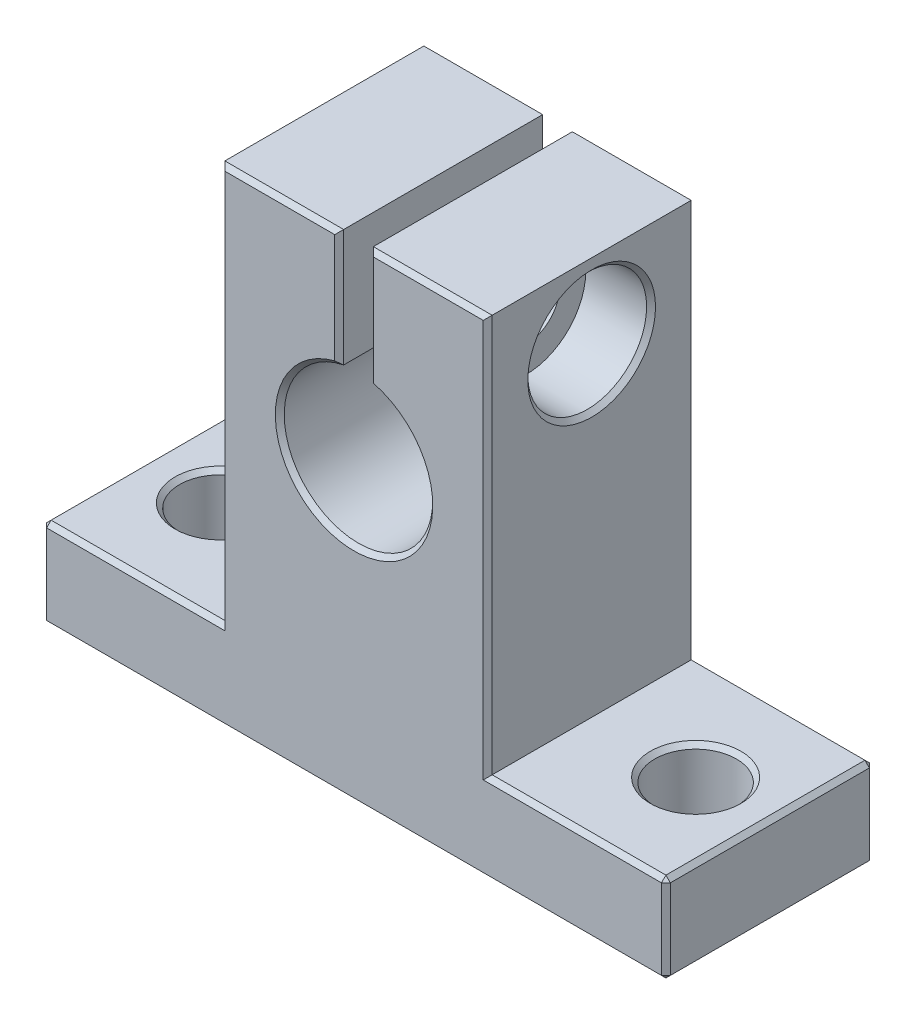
ISO-10303-21;
HEADER;
FILE_DESCRIPTION(('STEP AP214'),'2;1');
FILE_NAME('part.step','',(''),(''),'','','');
FILE_SCHEMA(('AUTOMOTIVE_DESIGN { 1 0 10303 214 1 1 1 1 }'));
ENDSEC;
DATA;
#1=APPLICATION_CONTEXT('core data for automotive mechanical design processes');
#2=APPLICATION_PROTOCOL_DEFINITION('international standard','automotive_design',2000,#1);
#3=PRODUCT_CONTEXT('',#1,'mechanical');
#4=PRODUCT('Part','Part','',(#3));
#5=PRODUCT_RELATED_PRODUCT_CATEGORY('part','',(#4));
#6=PRODUCT_DEFINITION_FORMATION('','',#4);
#7=PRODUCT_DEFINITION_CONTEXT('part definition',#1,'design');
#8=PRODUCT_DEFINITION('design','',#6,#7);
#9=PRODUCT_DEFINITION_SHAPE('','',#8);
#10=(LENGTH_UNIT() NAMED_UNIT(*) SI_UNIT(.MILLI.,.METRE.));
#11=(NAMED_UNIT(*) PLANE_ANGLE_UNIT() SI_UNIT($,.RADIAN.));
#12=(NAMED_UNIT(*) SI_UNIT($,.STERADIAN.) SOLID_ANGLE_UNIT());
#13=UNCERTAINTY_MEASURE_WITH_UNIT(LENGTH_MEASURE(1.E-05),#10,'distance_accuracy_value','');
#14=(GEOMETRIC_REPRESENTATION_CONTEXT(3) GLOBAL_UNCERTAINTY_ASSIGNED_CONTEXT((#13)) GLOBAL_UNIT_ASSIGNED_CONTEXT((#10,
#11,#12)) REPRESENTATION_CONTEXT('',''));
#15=CARTESIAN_POINT('',(0.,0.,0.));
#16=DIRECTION('',(0.,0.,1.));
#17=DIRECTION('',(1.,0.,0.));
#18=AXIS2_PLACEMENT_3D('',#15,#16,#17);
#19=CARTESIAN_POINT('',(-9.,32.8,7.));
#20=DIRECTION('',(0.,1.,0.));
#21=DIRECTION('',(-1.,0.,0.));
#22=AXIS2_PLACEMENT_3D('',#19,#20,#21);
#23=PLANE('',#22);
#24=DIRECTION('',(0.,0.,-1.));
#25=VECTOR('',#24,1.);
#26=CARTESIAN_POINT('',(9.,32.8,7.));
#27=LINE('',#26,#25);
#28=CARTESIAN_POINT('',(9.,32.8,6.7));
#29=VERTEX_POINT('',#28);
#30=CARTESIAN_POINT('',(9.,32.8,-6.69999999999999));
#31=VERTEX_POINT('',#30);
#32=EDGE_CURVE('E627',#29,#31,#27,.T.);
#33=ORIENTED_EDGE('',*,*,#32,.T.);
#34=DIRECTION('',(-1.,0.,0.));
#35=VECTOR('',#34,1.);
#36=CARTESIAN_POINT('',(-9.,32.8,-6.7));
#37=LINE('',#36,#35);
#38=CARTESIAN_POINT('',(1.,32.8,-6.7));
#39=VERTEX_POINT('',#38);
#40=EDGE_CURVE('E584',#31,#39,#37,.T.);
#41=ORIENTED_EDGE('',*,*,#40,.T.);
#42=DIRECTION('',(0.,0.,1.));
#43=VECTOR('',#42,1.);
#44=CARTESIAN_POINT('',(1.,32.8,-7.001));
#45=LINE('',#44,#43);
#46=CARTESIAN_POINT('',(1.,32.8,6.69999999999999));
#47=VERTEX_POINT('',#46);
#48=EDGE_CURVE('E434',#39,#47,#45,.T.);
#49=ORIENTED_EDGE('',*,*,#48,.T.);
#50=DIRECTION('',(1.,0.,0.));
#51=VECTOR('',#50,1.);
#52=CARTESIAN_POINT('',(9.,32.8,6.69999999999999));
#53=LINE('',#52,#51);
#54=EDGE_CURVE('E576',#47,#29,#53,.T.);
#55=ORIENTED_EDGE('',*,*,#54,.T.);
#56=EDGE_LOOP('',(#33,#41,#49,#55));
#57=FACE_BOUND('',#56,.T.);
#58=ADVANCED_FACE('F66',(#57),#23,.T.);
#59=CARTESIAN_POINT('',(0.,0.,7.));
#60=DIRECTION('',(0.,0.,-1.));
#61=DIRECTION('',(-1.,0.,0.));
#62=AXIS2_PLACEMENT_3D('',#59,#60,#61);
#63=PLANE('',#62);
#64=DIRECTION('',(-1.,0.,0.));
#65=VECTOR('',#64,1.);
#66=CARTESIAN_POINT('',(1.,32.5,7.));
#67=LINE('',#66,#65);
#68=CARTESIAN_POINT('',(8.69999999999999,32.5,7.));
#69=VERTEX_POINT('',#68);
#70=CARTESIAN_POINT('',(1.30000000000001,32.5,7.));
#71=VERTEX_POINT('',#70);
#72=EDGE_CURVE('E77',#69,#71,#67,.T.);
#73=ORIENTED_EDGE('',*,*,#72,.T.);
#74=DIRECTION('',(0.,-1.,0.));
#75=VECTOR('',#74,1.);
#76=CARTESIAN_POINT('',(1.30000000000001,24.8989794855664,7.));
#77=LINE('',#76,#75);
#78=CARTESIAN_POINT('',(1.30000000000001,25.1380930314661,7.));
#79=VERTEX_POINT('',#78);
#80=EDGE_CURVE('E12',#71,#79,#77,.T.);
#81=ORIENTED_EDGE('',*,*,#80,.T.);
#82=CARTESIAN_POINT('',(0.,20.,7.));
#83=DIRECTION('',(0.,0.,-1.));
#84=DIRECTION('',(-1.,0.,0.));
#85=AXIS2_PLACEMENT_3D('',#82,#83,#84);
#86=CIRCLE('',#85,5.3);
#87=CARTESIAN_POINT('',(-1.3,25.1380930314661,7.));
#88=VERTEX_POINT('',#87);
#89=EDGE_CURVE('E606',#79,#88,#86,.T.);
#90=ORIENTED_EDGE('',*,*,#89,.T.);
#91=DIRECTION('',(0.,1.,0.));
#92=VECTOR('',#91,1.);
#93=CARTESIAN_POINT('',(-1.3,0.,7.));
#94=LINE('',#93,#92);
#95=CARTESIAN_POINT('',(-1.3,32.5,7.));
#96=VERTEX_POINT('',#95);
#97=EDGE_CURVE('E603',#88,#96,#94,.T.);
#98=ORIENTED_EDGE('',*,*,#97,.T.);
#99=DIRECTION('',(-1.,0.,0.));
#100=VECTOR('',#99,1.);
#101=CARTESIAN_POINT('',(-9.,32.5,7.));
#102=LINE('',#101,#100);
#103=CARTESIAN_POINT('',(-8.7,32.5,7.));
#104=VERTEX_POINT('',#103);
#105=EDGE_CURVE('E601',#96,#104,#102,.T.);
#106=ORIENTED_EDGE('',*,*,#105,.T.);
#107=DIRECTION('',(0.,-1.,0.));
#108=VECTOR('',#107,1.);
#109=CARTESIAN_POINT('',(-8.7,6.,7.));
#110=LINE('',#109,#108);
#111=CARTESIAN_POINT('',(-8.7,5.7,7.));
#112=VERTEX_POINT('',#111);
#113=EDGE_CURVE('E598',#104,#112,#110,.T.);
#114=ORIENTED_EDGE('',*,*,#113,.T.);
#115=DIRECTION('',(-1.,0.,0.));
#116=VECTOR('',#115,1.);
#117=CARTESIAN_POINT('',(-21.,5.7,7.));
#118=LINE('',#117,#116);
#119=CARTESIAN_POINT('',(-20.7,5.7,7.));
#120=VERTEX_POINT('',#119);
#121=EDGE_CURVE('E596',#112,#120,#118,.T.);
#122=ORIENTED_EDGE('',*,*,#121,.T.);
#123=DIRECTION('',(0.,-1.,0.));
#124=VECTOR('',#123,1.);
#125=CARTESIAN_POINT('',(-20.7,0.,7.));
#126=LINE('',#125,#124);
#127=CARTESIAN_POINT('',(-20.7,0.300000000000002,7.));
#128=VERTEX_POINT('',#127);
#129=EDGE_CURVE('E597',#120,#128,#126,.T.);
#130=ORIENTED_EDGE('',*,*,#129,.T.);
#131=DIRECTION('',(1.,0.,0.));
#132=VECTOR('',#131,1.);
#133=CARTESIAN_POINT('',(21.,0.300000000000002,7.));
#134=LINE('',#133,#132);
#135=CARTESIAN_POINT('',(20.7,0.300000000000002,7.));
#136=VERTEX_POINT('',#135);
#137=EDGE_CURVE('E593',#128,#136,#134,.T.);
#138=ORIENTED_EDGE('',*,*,#137,.T.);
#139=DIRECTION('',(0.,1.,0.));
#140=VECTOR('',#139,1.);
#141=CARTESIAN_POINT('',(20.7,0.,7.));
#142=LINE('',#141,#140);
#143=CARTESIAN_POINT('',(20.7,5.69999999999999,7.));
#144=VERTEX_POINT('',#143);
#145=EDGE_CURVE('E591',#136,#144,#142,.T.);
#146=ORIENTED_EDGE('',*,*,#145,.T.);
#147=DIRECTION('',(-1.,0.,0.));
#148=VECTOR('',#147,1.);
#149=CARTESIAN_POINT('',(0.,5.69999999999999,7.));
#150=LINE('',#149,#148);
#151=CARTESIAN_POINT('',(8.69999999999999,5.69999999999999,7.));
#152=VERTEX_POINT('',#151);
#153=EDGE_CURVE('E608',#144,#152,#150,.T.);
#154=ORIENTED_EDGE('',*,*,#153,.T.);
#155=DIRECTION('',(0.,1.,0.));
#156=VECTOR('',#155,1.);
#157=CARTESIAN_POINT('',(8.69999999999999,0.,7.));
#158=LINE('',#157,#156);
#159=EDGE_CURVE('E90',#152,#69,#158,.T.);
#160=ORIENTED_EDGE('',*,*,#159,.T.);
#161=EDGE_LOOP('',(#73,#81,#90,#98,#106,#114,#122,#130,#138,#146,#154,#160));
#162=FACE_BOUND('',#161,.T.);
#163=ADVANCED_FACE('F400',(#162),#63,.F.);
#164=CARTESIAN_POINT('',(0.,0.,-7.));
#165=DIRECTION('',(0.,0.,-1.));
#166=DIRECTION('',(-1.,0.,0.));
#167=AXIS2_PLACEMENT_3D('',#164,#165,#166);
#168=PLANE('',#167);
#169=DIRECTION('',(0.,1.,0.));
#170=VECTOR('',#169,1.);
#171=CARTESIAN_POINT('',(-8.69999999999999,0.,-7.));
#172=LINE('',#171,#170);
#173=CARTESIAN_POINT('',(-8.69999999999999,5.69999999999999,-7.));
#174=VERTEX_POINT('',#173);
#175=CARTESIAN_POINT('',(-8.69999999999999,32.5,-7.));
#176=VERTEX_POINT('',#175);
#177=EDGE_CURVE('E680',#174,#176,#172,.T.);
#178=ORIENTED_EDGE('',*,*,#177,.T.);
#179=DIRECTION('',(1.,0.,0.));
#180=VECTOR('',#179,1.);
#181=CARTESIAN_POINT('',(0.,32.5,-7.));
#182=LINE('',#181,#180);
#183=CARTESIAN_POINT('',(-1.30000000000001,32.5,-7.));
#184=VERTEX_POINT('',#183);
#185=EDGE_CURVE('E677',#176,#184,#182,.T.);
#186=ORIENTED_EDGE('',*,*,#185,.T.);
#187=DIRECTION('',(0.,-1.,0.));
#188=VECTOR('',#187,1.);
#189=CARTESIAN_POINT('',(-1.30000000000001,24.8989794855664,-7.));
#190=LINE('',#189,#188);
#191=CARTESIAN_POINT('',(-1.30000000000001,25.1380930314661,-7.));
#192=VERTEX_POINT('',#191);
#193=EDGE_CURVE('E455',#184,#192,#190,.T.);
#194=ORIENTED_EDGE('',*,*,#193,.T.);
#195=CARTESIAN_POINT('',(0.,20.,-7.));
#196=DIRECTION('',(0.,0.,-1.));
#197=DIRECTION('',(-1.,0.,0.));
#198=AXIS2_PLACEMENT_3D('',#195,#196,#197);
#199=CIRCLE('',#198,5.30000000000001);
#200=CARTESIAN_POINT('',(1.3,25.1380930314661,-7.));
#201=VERTEX_POINT('',#200);
#202=EDGE_CURVE('E670',#192,#201,#199,.F.);
#203=ORIENTED_EDGE('',*,*,#202,.T.);
#204=DIRECTION('',(0.,1.,0.));
#205=VECTOR('',#204,1.);
#206=CARTESIAN_POINT('',(1.3,0.,-7.));
#207=LINE('',#206,#205);
#208=CARTESIAN_POINT('',(1.3,32.5,-7.));
#209=VERTEX_POINT('',#208);
#210=EDGE_CURVE('E669',#201,#209,#207,.T.);
#211=ORIENTED_EDGE('',*,*,#210,.T.);
#212=DIRECTION('',(1.,0.,0.));
#213=VECTOR('',#212,1.);
#214=CARTESIAN_POINT('',(0.,32.5,-7.));
#215=LINE('',#214,#213);
#216=CARTESIAN_POINT('',(8.7,32.5,-7.));
#217=VERTEX_POINT('',#216);
#218=EDGE_CURVE('E259',#209,#217,#215,.T.);
#219=ORIENTED_EDGE('',*,*,#218,.T.);
#220=DIRECTION('',(0.,-1.,0.));
#221=VECTOR('',#220,1.);
#222=CARTESIAN_POINT('',(8.7,5.99999999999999,-7.));
#223=LINE('',#222,#221);
#224=CARTESIAN_POINT('',(8.7,5.69999999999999,-7.));
#225=VERTEX_POINT('',#224);
#226=EDGE_CURVE('E249',#217,#225,#223,.T.);
#227=ORIENTED_EDGE('',*,*,#226,.T.);
#228=DIRECTION('',(1.,0.,0.));
#229=VECTOR('',#228,1.);
#230=CARTESIAN_POINT('',(21.,5.69999999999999,-7.));
#231=LINE('',#230,#229);
#232=CARTESIAN_POINT('',(20.7,5.69999999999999,-7.));
#233=VERTEX_POINT('',#232);
#234=EDGE_CURVE('E254',#225,#233,#231,.T.);
#235=ORIENTED_EDGE('',*,*,#234,.T.);
#236=DIRECTION('',(0.,-1.,0.));
#237=VECTOR('',#236,1.);
#238=CARTESIAN_POINT('',(20.7,0.,-7.));
#239=LINE('',#238,#237);
#240=CARTESIAN_POINT('',(20.7,0.300000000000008,-7.));
#241=VERTEX_POINT('',#240);
#242=EDGE_CURVE('E671',#233,#241,#239,.T.);
#243=ORIENTED_EDGE('',*,*,#242,.T.);
#244=DIRECTION('',(-1.,0.,0.));
#245=VECTOR('',#244,1.);
#246=CARTESIAN_POINT('',(0.,0.300000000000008,-7.));
#247=LINE('',#246,#245);
#248=CARTESIAN_POINT('',(-20.7,0.300000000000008,-7.));
#249=VERTEX_POINT('',#248);
#250=EDGE_CURVE('E673',#241,#249,#247,.T.);
#251=ORIENTED_EDGE('',*,*,#250,.T.);
#252=DIRECTION('',(0.,1.,0.));
#253=VECTOR('',#252,1.);
#254=CARTESIAN_POINT('',(-20.7,0.,-7.));
#255=LINE('',#254,#253);
#256=CARTESIAN_POINT('',(-20.7,5.69999999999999,-7.));
#257=VERTEX_POINT('',#256);
#258=EDGE_CURVE('E526',#249,#257,#255,.T.);
#259=ORIENTED_EDGE('',*,*,#258,.T.);
#260=DIRECTION('',(1.,0.,0.));
#261=VECTOR('',#260,1.);
#262=CARTESIAN_POINT('',(0.,5.69999999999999,-7.));
#263=LINE('',#262,#261);
#264=EDGE_CURVE('E679',#257,#174,#263,.T.);
#265=ORIENTED_EDGE('',*,*,#264,.T.);
#266=EDGE_LOOP('',(#178,#186,#194,#203,#211,#219,#227,#235,#243,#251,#259,#265));
#267=FACE_BOUND('',#266,.T.);
#268=ADVANCED_FACE('F255',(#267),#168,.T.);
#269=CARTESIAN_POINT('',(-21.,0.,7.));
#270=DIRECTION('',(-1.,0.,0.));
#271=DIRECTION('',(0.,0.,1.));
#272=AXIS2_PLACEMENT_3D('',#269,#270,#271);
#273=PLANE('',#272);
#274=DIRECTION('',(0.,0.,-1.));
#275=VECTOR('',#274,1.);
#276=CARTESIAN_POINT('',(-21.,5.69999999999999,7.));
#277=LINE('',#276,#275);
#278=CARTESIAN_POINT('',(-21.,5.69999999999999,6.69999999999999));
#279=VERTEX_POINT('',#278);
#280=CARTESIAN_POINT('',(-21.,5.69999999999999,-6.7));
#281=VERTEX_POINT('',#280);
#282=EDGE_CURVE('E544',#279,#281,#277,.T.);
#283=ORIENTED_EDGE('',*,*,#282,.T.);
#284=DIRECTION('',(0.,-1.,0.));
#285=VECTOR('',#284,1.);
#286=CARTESIAN_POINT('',(-21.,0.,-6.7));
#287=LINE('',#286,#285);
#288=CARTESIAN_POINT('',(-21.,0.300000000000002,-6.7));
#289=VERTEX_POINT('',#288);
#290=EDGE_CURVE('E524',#281,#289,#287,.T.);
#291=ORIENTED_EDGE('',*,*,#290,.T.);
#292=DIRECTION('',(0.,0.,1.));
#293=VECTOR('',#292,1.);
#294=CARTESIAN_POINT('',(-21.,0.300000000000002,7.));
#295=LINE('',#294,#293);
#296=CARTESIAN_POINT('',(-21.,0.300000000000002,6.69999999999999));
#297=VERTEX_POINT('',#296);
#298=EDGE_CURVE('E533',#289,#297,#295,.T.);
#299=ORIENTED_EDGE('',*,*,#298,.T.);
#300=DIRECTION('',(0.,1.,0.));
#301=VECTOR('',#300,1.);
#302=CARTESIAN_POINT('',(-21.,6.,6.69999999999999));
#303=LINE('',#302,#301);
#304=EDGE_CURVE('E537',#297,#279,#303,.T.);
#305=ORIENTED_EDGE('',*,*,#304,.T.);
#306=EDGE_LOOP('',(#283,#291,#299,#305));
#307=FACE_BOUND('',#306,.T.);
#308=ADVANCED_FACE('F543',(#307),#273,.T.);
#309=CARTESIAN_POINT('',(21.,0.,7.));
#310=DIRECTION('',(0.,-1.,0.));
#311=DIRECTION('',(0.,0.,-1.));
#312=AXIS2_PLACEMENT_3D('',#309,#310,#311);
#313=PLANE('',#312);
#314=DIRECTION('',(0.,0.,-1.));
#315=VECTOR('',#314,1.);
#316=CARTESIAN_POINT('',(-20.7,0.,7.));
#317=LINE('',#316,#315);
#318=CARTESIAN_POINT('',(-20.7,0.,6.69999999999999));
#319=VERTEX_POINT('',#318);
#320=CARTESIAN_POINT('',(-20.7,0.,-6.7));
#321=VERTEX_POINT('',#320);
#322=EDGE_CURVE('E555',#319,#321,#317,.T.);
#323=ORIENTED_EDGE('',*,*,#322,.T.);
#324=DIRECTION('',(1.,0.,0.));
#325=VECTOR('',#324,1.);
#326=CARTESIAN_POINT('',(21.,0.,-6.7));
#327=LINE('',#326,#325);
#328=CARTESIAN_POINT('',(20.7,0.,-6.7));
#329=VERTEX_POINT('',#328);
#330=EDGE_CURVE('E558',#321,#329,#327,.T.);
#331=ORIENTED_EDGE('',*,*,#330,.T.);
#332=DIRECTION('',(0.,0.,1.));
#333=VECTOR('',#332,1.);
#334=CARTESIAN_POINT('',(20.7,0.,7.));
#335=LINE('',#334,#333);
#336=CARTESIAN_POINT('',(20.7,0.,6.69999999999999));
#337=VERTEX_POINT('',#336);
#338=EDGE_CURVE('E549',#329,#337,#335,.T.);
#339=ORIENTED_EDGE('',*,*,#338,.T.);
#340=DIRECTION('',(-1.,0.,0.));
#341=VECTOR('',#340,1.);
#342=CARTESIAN_POINT('',(-21.,0.,6.69999999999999));
#343=LINE('',#342,#341);
#344=EDGE_CURVE('E550',#337,#319,#343,.T.);
#345=ORIENTED_EDGE('',*,*,#344,.T.);
#346=EDGE_LOOP('',(#323,#331,#339,#345));
#347=FACE_BOUND('',#346,.T.);
#348=CARTESIAN_POINT('',(-16.,0.,0.));
#349=DIRECTION('',(0.,1.,0.));
#350=DIRECTION('',(0.,0.,1.));
#351=AXIS2_PLACEMENT_3D('',#348,#349,#350);
#352=CIRCLE('',#351,2.75000000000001);
#353=CARTESIAN_POINT('',(-16.,0.,2.75000000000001));
#354=VERTEX_POINT('',#353);
#355=EDGE_CURVE('E1022',#354,#354,#352,.T.);
#356=ORIENTED_EDGE('',*,*,#355,.T.);
#357=EDGE_LOOP('',(#356));
#358=FACE_BOUND('',#357,.T.);
#359=CARTESIAN_POINT('',(16.,0.,0.));
#360=DIRECTION('',(0.,1.,0.));
#361=DIRECTION('',(0.,0.,1.));
#362=AXIS2_PLACEMENT_3D('',#359,#360,#361);
#363=CIRCLE('',#362,2.75000000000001);
#364=CARTESIAN_POINT('',(16.,0.,2.75000000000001));
#365=VERTEX_POINT('',#364);
#366=EDGE_CURVE('E1024',#365,#365,#363,.T.);
#367=ORIENTED_EDGE('',*,*,#366,.T.);
#368=EDGE_LOOP('',(#367));
#369=FACE_BOUND('',#368,.T.);
#370=ADVANCED_FACE('F720',(#347,#358,#369),#313,.T.);
#371=CARTESIAN_POINT('',(21.,0.,7.));
#372=DIRECTION('',(-1.,0.,0.));
#373=DIRECTION('',(0.,0.,1.));
#374=AXIS2_PLACEMENT_3D('',#371,#372,#373);
#375=PLANE('',#374);
#376=DIRECTION('',(0.,0.,-1.));
#377=VECTOR('',#376,1.);
#378=CARTESIAN_POINT('',(21.,0.300000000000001,-7.));
#379=LINE('',#378,#377);
#380=CARTESIAN_POINT('',(21.,0.300000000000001,6.7));
#381=VERTEX_POINT('',#380);
#382=CARTESIAN_POINT('',(21.,0.300000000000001,-6.7));
#383=VERTEX_POINT('',#382);
#384=EDGE_CURVE('E563',#381,#383,#379,.T.);
#385=ORIENTED_EDGE('',*,*,#384,.T.);
#386=DIRECTION('',(0.,1.,0.));
#387=VECTOR('',#386,1.);
#388=CARTESIAN_POINT('',(21.,5.99999999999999,-6.7));
#389=LINE('',#388,#387);
#390=CARTESIAN_POINT('',(21.,5.69999999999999,-6.7));
#391=VERTEX_POINT('',#390);
#392=EDGE_CURVE('E564',#383,#391,#389,.T.);
#393=ORIENTED_EDGE('',*,*,#392,.T.);
#394=DIRECTION('',(0.,0.,1.));
#395=VECTOR('',#394,1.);
#396=CARTESIAN_POINT('',(21.,5.69999999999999,7.));
#397=LINE('',#396,#395);
#398=CARTESIAN_POINT('',(21.,5.69999999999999,6.7));
#399=VERTEX_POINT('',#398);
#400=EDGE_CURVE('E559',#391,#399,#397,.T.);
#401=ORIENTED_EDGE('',*,*,#400,.T.);
#402=DIRECTION('',(0.,-1.,0.));
#403=VECTOR('',#402,1.);
#404=CARTESIAN_POINT('',(21.,0.,6.7));
#405=LINE('',#404,#403);
#406=EDGE_CURVE('E561',#399,#381,#405,.T.);
#407=ORIENTED_EDGE('',*,*,#406,.T.);
#408=EDGE_LOOP('',(#385,#393,#401,#407));
#409=FACE_BOUND('',#408,.T.);
#410=ADVANCED_FACE('F804',(#409),#375,.F.);
#411=CARTESIAN_POINT('',(21.,5.99999999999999,7.));
#412=DIRECTION('',(0.,-1.,0.));
#413=DIRECTION('',(0.,0.,-1.));
#414=AXIS2_PLACEMENT_3D('',#411,#412,#413);
#415=PLANE('',#414);
#416=CARTESIAN_POINT('',(16.,5.99999999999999,0.));
#417=DIRECTION('',(0.,-1.,0.));
#418=DIRECTION('',(0.,0.,-1.));
#419=AXIS2_PLACEMENT_3D('',#416,#417,#418);
#420=CIRCLE('',#419,3.05);
#421=CARTESIAN_POINT('',(16.,5.99999999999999,-3.05));
#422=VERTEX_POINT('',#421);
#423=EDGE_CURVE('E656',#422,#422,#420,.T.);
#424=ORIENTED_EDGE('',*,*,#423,.T.);
#425=EDGE_LOOP('',(#424));
#426=FACE_BOUND('',#425,.T.);
#427=DIRECTION('',(0.,0.,-1.));
#428=VECTOR('',#427,1.);
#429=CARTESIAN_POINT('',(20.7,5.99999999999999,7.));
#430=LINE('',#429,#428);
#431=CARTESIAN_POINT('',(20.7,5.99999999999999,6.69999999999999));
#432=VERTEX_POINT('',#431);
#433=CARTESIAN_POINT('',(20.7,5.99999999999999,-6.69999999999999));
#434=VERTEX_POINT('',#433);
#435=EDGE_CURVE('E586',#432,#434,#430,.T.);
#436=ORIENTED_EDGE('',*,*,#435,.T.);
#437=DIRECTION('',(-1.,0.,0.));
#438=VECTOR('',#437,1.);
#439=CARTESIAN_POINT('',(9.,5.99999999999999,-6.69999999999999));
#440=LINE('',#439,#438);
#441=CARTESIAN_POINT('',(9.,5.99999999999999,-6.69999999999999));
#442=VERTEX_POINT('',#441);
#443=EDGE_CURVE('E589',#434,#442,#440,.T.);
#444=ORIENTED_EDGE('',*,*,#443,.T.);
#445=DIRECTION('',(0.,0.,-1.));
#446=VECTOR('',#445,1.);
#447=CARTESIAN_POINT('',(9.,5.99999999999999,7.));
#448=LINE('',#447,#446);
#449=CARTESIAN_POINT('',(9.,5.99999999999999,6.69999999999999));
#450=VERTEX_POINT('',#449);
#451=EDGE_CURVE('E626',#450,#442,#448,.T.);
#452=ORIENTED_EDGE('',*,*,#451,.F.);
#453=DIRECTION('',(1.,0.,0.));
#454=VECTOR('',#453,1.);
#455=CARTESIAN_POINT('',(21.,5.99999999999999,6.69999999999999));
#456=LINE('',#455,#454);
#457=EDGE_CURVE('E588',#450,#432,#456,.T.);
#458=ORIENTED_EDGE('',*,*,#457,.T.);
#459=EDGE_LOOP('',(#436,#444,#452,#458));
#460=FACE_BOUND('',#459,.T.);
#461=ADVANCED_FACE('F417',(#426,#460),#415,.F.);
#462=CARTESIAN_POINT('',(9.,5.99999999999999,7.));
#463=DIRECTION('',(-1.,0.,0.));
#464=DIRECTION('',(0.,0.,1.));
#465=AXIS2_PLACEMENT_3D('',#462,#463,#464);
#466=PLANE('',#465);
#467=CARTESIAN_POINT('',(9.,27.8,0.));
#468=DIRECTION('',(-1.,0.,0.));
#469=DIRECTION('',(0.,0.,1.));
#470=AXIS2_PLACEMENT_3D('',#467,#468,#469);
#471=CIRCLE('',#470,4.30000000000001);
#472=CARTESIAN_POINT('',(9.,27.8,-4.30000000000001));
#473=VERTEX_POINT('',#472);
#474=EDGE_CURVE('E272',#473,#473,#471,.T.);
#475=ORIENTED_EDGE('',*,*,#474,.T.);
#476=EDGE_LOOP('',(#475));
#477=FACE_BOUND('',#476,.T.);
#478=ORIENTED_EDGE('',*,*,#451,.T.);
#479=DIRECTION('',(0.,1.,0.));
#480=VECTOR('',#479,1.);
#481=CARTESIAN_POINT('',(9.,32.8,-6.69999999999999));
#482=LINE('',#481,#480);
#483=EDGE_CURVE('E274',#442,#31,#482,.T.);
#484=ORIENTED_EDGE('',*,*,#483,.T.);
#485=ORIENTED_EDGE('',*,*,#32,.F.);
#486=DIRECTION('',(0.,-1.,0.));
#487=VECTOR('',#486,1.);
#488=CARTESIAN_POINT('',(9.,5.99999999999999,6.7));
#489=LINE('',#488,#487);
#490=EDGE_CURVE('E585',#29,#450,#489,.T.);
#491=ORIENTED_EDGE('',*,*,#490,.T.);
#492=EDGE_LOOP('',(#478,#484,#485,#491));
#493=FACE_BOUND('',#492,.T.);
#494=ADVANCED_FACE('F415',(#477,#493),#466,.F.);
#495=DIRECTION('',(0.,0.,1.));
#496=VECTOR('',#495,1.);
#497=CARTESIAN_POINT('',(-1.,32.8,-7.001));
#498=LINE('',#497,#496);
#499=CARTESIAN_POINT('',(-1.,32.8,-6.7));
#500=VERTEX_POINT('',#499);
#501=CARTESIAN_POINT('',(-1.,32.8,6.69999999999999));
#502=VERTEX_POINT('',#501);
#503=EDGE_CURVE('E424',#500,#502,#498,.T.);
#504=ORIENTED_EDGE('',*,*,#503,.F.);
#505=DIRECTION('',(-1.,0.,0.));
#506=VECTOR('',#505,1.);
#507=CARTESIAN_POINT('',(-9.,32.8,-6.7));
#508=LINE('',#507,#506);
#509=CARTESIAN_POINT('',(-9.,32.8,-6.7));
#510=VERTEX_POINT('',#509);
#511=EDGE_CURVE('E426',#500,#510,#508,.T.);
#512=ORIENTED_EDGE('',*,*,#511,.T.);
#513=DIRECTION('',(0.,0.,-1.));
#514=VECTOR('',#513,1.);
#515=CARTESIAN_POINT('',(-9.,32.8,7.));
#516=LINE('',#515,#514);
#517=CARTESIAN_POINT('',(-9.,32.8,6.69999999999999));
#518=VERTEX_POINT('',#517);
#519=EDGE_CURVE('E632',#518,#510,#516,.T.);
#520=ORIENTED_EDGE('',*,*,#519,.F.);
#521=DIRECTION('',(1.,0.,0.));
#522=VECTOR('',#521,1.);
#523=CARTESIAN_POINT('',(-1.,32.8,6.69999999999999));
#524=LINE('',#523,#522);
#525=EDGE_CURVE('E431',#518,#502,#524,.T.);
#526=ORIENTED_EDGE('',*,*,#525,.T.);
#527=EDGE_LOOP('',(#504,#512,#520,#526));
#528=FACE_BOUND('',#527,.T.);
#529=ADVANCED_FACE('F402',(#528),#23,.T.);
#530=CARTESIAN_POINT('',(-9.,6.,7.));
#531=DIRECTION('',(-1.,0.,0.));
#532=DIRECTION('',(0.,0.,1.));
#533=AXIS2_PLACEMENT_3D('',#530,#531,#532);
#534=PLANE('',#533);
#535=CARTESIAN_POINT('',(-9.,27.8,0.));
#536=DIRECTION('',(-1.,0.,0.));
#537=DIRECTION('',(0.,0.,1.));
#538=AXIS2_PLACEMENT_3D('',#535,#536,#537);
#539=CIRCLE('',#538,2.55000000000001);
#540=CARTESIAN_POINT('',(-9.,27.8,2.55000000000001));
#541=VERTEX_POINT('',#540);
#542=EDGE_CURVE('E635',#541,#541,#539,.F.);
#543=ORIENTED_EDGE('',*,*,#542,.T.);
#544=EDGE_LOOP('',(#543));
#545=FACE_BOUND('',#544,.T.);
#546=ORIENTED_EDGE('',*,*,#519,.T.);
#547=DIRECTION('',(0.,-1.,0.));
#548=VECTOR('',#547,1.);
#549=CARTESIAN_POINT('',(-9.,6.,-6.7));
#550=LINE('',#549,#548);
#551=CARTESIAN_POINT('',(-9.,6.,-6.7));
#552=VERTEX_POINT('',#551);
#553=EDGE_CURVE('E685',#510,#552,#550,.T.);
#554=ORIENTED_EDGE('',*,*,#553,.T.);
#555=DIRECTION('',(0.,0.,-1.));
#556=VECTOR('',#555,1.);
#557=CARTESIAN_POINT('',(-9.,6.,7.));
#558=LINE('',#557,#556);
#559=CARTESIAN_POINT('',(-9.,6.,6.69999999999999));
#560=VERTEX_POINT('',#559);
#561=EDGE_CURVE('E432',#560,#552,#558,.T.);
#562=ORIENTED_EDGE('',*,*,#561,.F.);
#563=DIRECTION('',(0.,1.,0.));
#564=VECTOR('',#563,1.);
#565=CARTESIAN_POINT('',(-9.,32.8,6.69999999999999));
#566=LINE('',#565,#564);
#567=EDGE_CURVE('E447',#560,#518,#566,.T.);
#568=ORIENTED_EDGE('',*,*,#567,.T.);
#569=EDGE_LOOP('',(#546,#554,#562,#568));
#570=FACE_BOUND('',#569,.T.);
#571=ADVANCED_FACE('F411',(#545,#570),#534,.T.);
#572=CARTESIAN_POINT('',(-21.,6.,7.));
#573=DIRECTION('',(0.,1.,0.));
#574=DIRECTION('',(0.,0.,1.));
#575=AXIS2_PLACEMENT_3D('',#572,#573,#574);
#576=PLANE('',#575);
#577=ORIENTED_EDGE('',*,*,#561,.T.);
#578=DIRECTION('',(-1.,0.,0.));
#579=VECTOR('',#578,1.);
#580=CARTESIAN_POINT('',(-21.,6.,-6.7));
#581=LINE('',#580,#579);
#582=CARTESIAN_POINT('',(-20.7,6.,-6.7));
#583=VERTEX_POINT('',#582);
#584=EDGE_CURVE('E541',#552,#583,#581,.T.);
#585=ORIENTED_EDGE('',*,*,#584,.T.);
#586=DIRECTION('',(0.,0.,1.));
#587=VECTOR('',#586,1.);
#588=CARTESIAN_POINT('',(-20.7,6.,7.));
#589=LINE('',#588,#587);
#590=CARTESIAN_POINT('',(-20.7,6.,6.69999999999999));
#591=VERTEX_POINT('',#590);
#592=EDGE_CURVE('E688',#583,#591,#589,.T.);
#593=ORIENTED_EDGE('',*,*,#592,.T.);
#594=DIRECTION('',(1.,0.,0.));
#595=VECTOR('',#594,1.);
#596=CARTESIAN_POINT('',(-9.,6.,6.69999999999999));
#597=LINE('',#596,#595);
#598=EDGE_CURVE('E686',#591,#560,#597,.T.);
#599=ORIENTED_EDGE('',*,*,#598,.T.);
#600=EDGE_LOOP('',(#577,#585,#593,#599));
#601=FACE_BOUND('',#600,.T.);
#602=CARTESIAN_POINT('',(-16.,6.,0.));
#603=DIRECTION('',(0.,1.,0.));
#604=DIRECTION('',(0.,0.,1.));
#605=AXIS2_PLACEMENT_3D('',#602,#603,#604);
#606=CIRCLE('',#605,3.05000000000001);
#607=CARTESIAN_POINT('',(-16.,6.,3.05000000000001));
#608=VERTEX_POINT('',#607);
#609=EDGE_CURVE('E651',#608,#608,#606,.F.);
#610=ORIENTED_EDGE('',*,*,#609,.T.);
#611=EDGE_LOOP('',(#610));
#612=FACE_BOUND('',#611,.T.);
#613=ADVANCED_FACE('F420',(#601,#612),#576,.T.);
#614=CARTESIAN_POINT('',(0.,20.,7.));
#615=DIRECTION('',(0.,0.,-1.));
#616=DIRECTION('',(-1.,0.,0.));
#617=AXIS2_PLACEMENT_3D('',#614,#615,#616);
#618=CYLINDRICAL_SURFACE('',#617,5.);
#619=DIRECTION('',(0.,0.,-1.));
#620=VECTOR('',#619,1.);
#621=CARTESIAN_POINT('',(0.999999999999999,24.8989794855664,7.));
#622=LINE('',#621,#620);
#623=CARTESIAN_POINT('',(0.999999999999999,24.8989794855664,-6.69999999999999));
#624=VERTEX_POINT('',#623);
#625=CARTESIAN_POINT('',(0.999999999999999,24.8989794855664,6.69999999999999));
#626=VERTEX_POINT('',#625);
#627=EDGE_CURVE('E1027',#624,#626,#622,.F.);
#628=ORIENTED_EDGE('',*,*,#627,.F.);
#629=CARTESIAN_POINT('',(0.,20.,-6.7));
#630=DIRECTION('',(0.,0.,-1.));
#631=DIRECTION('',(-1.,0.,0.));
#632=AXIS2_PLACEMENT_3D('',#629,#630,#631);
#633=CIRCLE('',#632,5.);
#634=CARTESIAN_POINT('',(-0.999999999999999,24.8989794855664,-6.7));
#635=VERTEX_POINT('',#634);
#636=EDGE_CURVE('E572',#624,#635,#633,.T.);
#637=ORIENTED_EDGE('',*,*,#636,.T.);
#638=DIRECTION('',(0.,0.,-1.));
#639=VECTOR('',#638,1.);
#640=CARTESIAN_POINT('',(-0.999999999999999,24.8989794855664,7.));
#641=LINE('',#640,#639);
#642=CARTESIAN_POINT('',(-0.999999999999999,24.8989794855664,6.69999999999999));
#643=VERTEX_POINT('',#642);
#644=EDGE_CURVE('E1039',#635,#643,#641,.F.);
#645=ORIENTED_EDGE('',*,*,#644,.T.);
#646=CARTESIAN_POINT('',(0.,20.,6.69999999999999));
#647=DIRECTION('',(0.,0.,-1.));
#648=DIRECTION('',(-1.,0.,0.));
#649=AXIS2_PLACEMENT_3D('',#646,#647,#648);
#650=CIRCLE('',#649,5.);
#651=EDGE_CURVE('E571',#643,#626,#650,.F.);
#652=ORIENTED_EDGE('',*,*,#651,.T.);
#653=EDGE_LOOP('',(#628,#637,#645,#652));
#654=FACE_BOUND('',#653,.T.);
#655=ADVANCED_FACE('F1001',(#654),#618,.F.);
#656=CARTESIAN_POINT('',(1.,32.8,-7.001));
#657=DIRECTION('',(-1.,0.,0.));
#658=DIRECTION('',(0.,-1.,0.));
#659=AXIS2_PLACEMENT_3D('',#656,#657,#658);
#660=PLANE('',#659);
#661=CARTESIAN_POINT('',(0.999999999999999,27.8,0.));
#662=DIRECTION('',(-1.,0.,0.));
#663=DIRECTION('',(0.,-1.,0.));
#664=AXIS2_PLACEMENT_3D('',#661,#662,#663);
#665=CIRCLE('',#664,2.25);
#666=CARTESIAN_POINT('',(0.999999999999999,25.55,0.));
#667=VERTEX_POINT('',#666);
#668=EDGE_CURVE('E642',#667,#667,#665,.T.);
#669=ORIENTED_EDGE('',*,*,#668,.F.);
#670=EDGE_LOOP('',(#669));
#671=FACE_BOUND('',#670,.T.);
#672=ORIENTED_EDGE('',*,*,#48,.F.);
#673=DIRECTION('',(0.,-1.,0.));
#674=VECTOR('',#673,1.);
#675=CARTESIAN_POINT('',(1.,32.8,-6.69999999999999));
#676=LINE('',#675,#674);
#677=EDGE_CURVE('E580',#39,#624,#676,.T.);
#678=ORIENTED_EDGE('',*,*,#677,.T.);
#679=ORIENTED_EDGE('',*,*,#627,.T.);
#680=DIRECTION('',(0.,1.,0.));
#681=VECTOR('',#680,1.);
#682=CARTESIAN_POINT('',(1.,32.8,6.7));
#683=LINE('',#682,#681);
#684=EDGE_CURVE('E574',#626,#47,#683,.T.);
#685=ORIENTED_EDGE('',*,*,#684,.T.);
#686=EDGE_LOOP('',(#672,#678,#679,#685));
#687=FACE_BOUND('',#686,.T.);
#688=ADVANCED_FACE('F1007',(#671,#687),#660,.T.);
#689=CARTESIAN_POINT('',(-1.,32.8,-7.001));
#690=DIRECTION('',(-1.,0.,0.));
#691=DIRECTION('',(0.,-1.,0.));
#692=AXIS2_PLACEMENT_3D('',#689,#690,#691);
#693=PLANE('',#692);
#694=CARTESIAN_POINT('',(-0.999999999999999,27.8,0.));
#695=DIRECTION('',(-1.,0.,0.));
#696=DIRECTION('',(0.,-1.,0.));
#697=AXIS2_PLACEMENT_3D('',#694,#695,#696);
#698=CIRCLE('',#697,2.25);
#699=CARTESIAN_POINT('',(-0.999999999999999,25.55,0.));
#700=VERTEX_POINT('',#699);
#701=EDGE_CURVE('E644',#700,#700,#698,.T.);
#702=ORIENTED_EDGE('',*,*,#701,.T.);
#703=EDGE_LOOP('',(#702));
#704=FACE_BOUND('',#703,.T.);
#705=ORIENTED_EDGE('',*,*,#644,.F.);
#706=DIRECTION('',(0.,1.,0.));
#707=VECTOR('',#706,1.);
#708=CARTESIAN_POINT('',(-1.,32.8,-6.7));
#709=LINE('',#708,#707);
#710=EDGE_CURVE('E451',#635,#500,#709,.T.);
#711=ORIENTED_EDGE('',*,*,#710,.T.);
#712=ORIENTED_EDGE('',*,*,#503,.T.);
#713=DIRECTION('',(0.,-1.,0.));
#714=VECTOR('',#713,1.);
#715=CARTESIAN_POINT('',(-1.,32.8,6.69999999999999));
#716=LINE('',#715,#714);
#717=EDGE_CURVE('E568',#502,#643,#716,.T.);
#718=ORIENTED_EDGE('',*,*,#717,.T.);
#719=EDGE_LOOP('',(#705,#711,#712,#718));
#720=FACE_BOUND('',#719,.T.);
#721=ADVANCED_FACE('F1078',(#704,#720),#693,.F.);
#722=CARTESIAN_POINT('',(16.,6.,0.));
#723=DIRECTION('',(0.,1.,0.));
#724=DIRECTION('',(0.,0.,1.));
#725=AXIS2_PLACEMENT_3D('',#722,#723,#724);
#726=CYLINDRICAL_SURFACE('',#725,2.75000000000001);
#727=CARTESIAN_POINT('',(16.,5.70000000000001,0.));
#728=DIRECTION('',(0.,-1.,0.));
#729=DIRECTION('',(0.,0.,-1.));
#730=AXIS2_PLACEMENT_3D('',#727,#728,#729);
#731=CIRCLE('',#730,2.75000000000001);
#732=CARTESIAN_POINT('',(16.,5.70000000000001,-2.75000000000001));
#733=VERTEX_POINT('',#732);
#734=EDGE_CURVE('E652',#733,#733,#731,.F.);
#735=ORIENTED_EDGE('',*,*,#734,.T.);
#736=EDGE_LOOP('',(#735));
#737=FACE_BOUND('',#736,.T.);
#738=ORIENTED_EDGE('',*,*,#366,.F.);
#739=EDGE_LOOP('',(#738));
#740=FACE_BOUND('',#739,.T.);
#741=ADVANCED_FACE('F1019',(#737,#740),#726,.F.);
#742=CARTESIAN_POINT('',(-16.,6.,0.));
#743=DIRECTION('',(0.,1.,0.));
#744=DIRECTION('',(0.,0.,1.));
#745=AXIS2_PLACEMENT_3D('',#742,#743,#744);
#746=CYLINDRICAL_SURFACE('',#745,2.75000000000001);
#747=CARTESIAN_POINT('',(-16.,5.7,0.));
#748=DIRECTION('',(0.,1.,0.));
#749=DIRECTION('',(0.,0.,1.));
#750=AXIS2_PLACEMENT_3D('',#747,#748,#749);
#751=CIRCLE('',#750,2.75000000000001);
#752=CARTESIAN_POINT('',(-16.,5.7,2.75000000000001));
#753=VERTEX_POINT('',#752);
#754=EDGE_CURVE('E650',#753,#753,#751,.T.);
#755=ORIENTED_EDGE('',*,*,#754,.T.);
#756=EDGE_LOOP('',(#755));
#757=FACE_BOUND('',#756,.T.);
#758=ORIENTED_EDGE('',*,*,#355,.F.);
#759=EDGE_LOOP('',(#758));
#760=FACE_BOUND('',#759,.T.);
#761=ADVANCED_FACE('F1016',(#757,#760),#746,.F.);
#762=CARTESIAN_POINT('',(9.,27.8,0.));
#763=DIRECTION('',(1.,0.,0.));
#764=DIRECTION('',(0.,0.,-1.));
#765=AXIS2_PLACEMENT_3D('',#762,#763,#764);
#766=CYLINDRICAL_SURFACE('',#765,4.);
#767=CARTESIAN_POINT('',(8.69999999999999,27.8,0.));
#768=DIRECTION('',(-1.,0.,0.));
#769=DIRECTION('',(0.,0.,1.));
#770=AXIS2_PLACEMENT_3D('',#767,#768,#769);
#771=CIRCLE('',#770,4.);
#772=CARTESIAN_POINT('',(8.7,27.8,-4.));
#773=VERTEX_POINT('',#772);
#774=EDGE_CURVE('E657',#773,#773,#771,.F.);
#775=ORIENTED_EDGE('',*,*,#774,.T.);
#776=EDGE_LOOP('',(#775));
#777=FACE_BOUND('',#776,.T.);
#778=CARTESIAN_POINT('',(4.6,27.8,0.));
#779=DIRECTION('',(1.,0.,0.));
#780=DIRECTION('',(0.,0.,-1.));
#781=AXIS2_PLACEMENT_3D('',#778,#779,#780);
#782=CIRCLE('',#781,4.);
#783=CARTESIAN_POINT('',(4.6,27.8,-4.));
#784=VERTEX_POINT('',#783);
#785=EDGE_CURVE('E1055',#784,#784,#782,.T.);
#786=ORIENTED_EDGE('',*,*,#785,.F.);
#787=EDGE_LOOP('',(#786));
#788=FACE_BOUND('',#787,.T.);
#789=ADVANCED_FACE('F1017',(#777,#788),#766,.F.);
#790=CARTESIAN_POINT('',(4.6,30.05,0.));
#791=DIRECTION('',(-1.,0.,0.));
#792=DIRECTION('',(0.,0.,1.));
#793=AXIS2_PLACEMENT_3D('',#790,#791,#792);
#794=PLANE('',#793);
#795=CARTESIAN_POINT('',(4.6,27.8,0.));
#796=DIRECTION('',(1.,0.,0.));
#797=DIRECTION('',(0.,0.,-1.));
#798=AXIS2_PLACEMENT_3D('',#795,#796,#797);
#799=CIRCLE('',#798,2.25);
#800=CARTESIAN_POINT('',(4.6,27.8,-2.25));
#801=VERTEX_POINT('',#800);
#802=EDGE_CURVE('E641',#801,#801,#799,.T.);
#803=ORIENTED_EDGE('',*,*,#802,.F.);
#804=EDGE_LOOP('',(#803));
#805=FACE_BOUND('',#804,.T.);
#806=ORIENTED_EDGE('',*,*,#785,.T.);
#807=EDGE_LOOP('',(#806));
#808=FACE_BOUND('',#807,.T.);
#809=ADVANCED_FACE('F1065',(#805,#808),#794,.F.);
#810=CARTESIAN_POINT('',(9.,27.8,0.));
#811=DIRECTION('',(1.,0.,0.));
#812=DIRECTION('',(0.,0.,-1.));
#813=AXIS2_PLACEMENT_3D('',#810,#811,#812);
#814=CYLINDRICAL_SURFACE('',#813,2.25);
#815=ORIENTED_EDGE('',*,*,#668,.T.);
#816=EDGE_LOOP('',(#815));
#817=FACE_BOUND('',#816,.T.);
#818=ORIENTED_EDGE('',*,*,#802,.T.);
#819=EDGE_LOOP('',(#818));
#820=FACE_BOUND('',#819,.T.);
#821=ADVANCED_FACE('F1057',(#817,#820),#814,.F.);
#822=CARTESIAN_POINT('',(-8.69999999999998,27.8,0.));
#823=DIRECTION('',(-1.,0.,0.));
#824=DIRECTION('',(0.,0.,1.));
#825=AXIS2_PLACEMENT_3D('',#822,#823,#824);
#826=CIRCLE('',#825,2.25);
#827=CARTESIAN_POINT('',(-8.69999999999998,27.8,2.25));
#828=VERTEX_POINT('',#827);
#829=EDGE_CURVE('E628',#828,#828,#826,.T.);
#830=ORIENTED_EDGE('',*,*,#829,.T.);
#831=EDGE_LOOP('',(#830));
#832=FACE_BOUND('',#831,.T.);
#833=ORIENTED_EDGE('',*,*,#701,.F.);
#834=EDGE_LOOP('',(#833));
#835=FACE_BOUND('',#834,.T.);
#836=ADVANCED_FACE('F1000',(#832,#835),#814,.F.);
#837=CARTESIAN_POINT('',(-8.69999999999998,27.8,0.));
#838=DIRECTION('',(-1.,0.,0.));
#839=DIRECTION('',(0.,0.,1.));
#840=AXIS2_PLACEMENT_3D('',#837,#838,#839);
#841=CONICAL_SURFACE('',#840,2.25,0.785398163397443);
#842=ORIENTED_EDGE('',*,*,#542,.F.);
#843=EDGE_LOOP('',(#842));
#844=FACE_BOUND('',#843,.T.);
#845=ORIENTED_EDGE('',*,*,#829,.F.);
#846=EDGE_LOOP('',(#845));
#847=FACE_BOUND('',#846,.T.);
#848=ADVANCED_FACE('F994',(#844,#847),#841,.F.);
#849=CARTESIAN_POINT('',(-16.,5.7,0.));
#850=DIRECTION('',(0.,1.,0.));
#851=DIRECTION('',(0.,0.,1.));
#852=AXIS2_PLACEMENT_3D('',#849,#850,#851);
#853=CONICAL_SURFACE('',#852,2.75000000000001,0.78539816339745);
#854=ORIENTED_EDGE('',*,*,#609,.F.);
#855=EDGE_LOOP('',(#854));
#856=FACE_BOUND('',#855,.T.);
#857=ORIENTED_EDGE('',*,*,#754,.F.);
#858=EDGE_LOOP('',(#857));
#859=FACE_BOUND('',#858,.T.);
#860=ADVANCED_FACE('F983',(#856,#859),#853,.F.);
#861=CARTESIAN_POINT('',(16.,5.70000000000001,0.));
#862=DIRECTION('',(0.,1.,0.));
#863=DIRECTION('',(0.,0.,1.));
#864=AXIS2_PLACEMENT_3D('',#861,#862,#863);
#865=CONICAL_SURFACE('',#864,2.75000000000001,0.78539816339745);
#866=ORIENTED_EDGE('',*,*,#423,.F.);
#867=EDGE_LOOP('',(#866));
#868=FACE_BOUND('',#867,.T.);
#869=ORIENTED_EDGE('',*,*,#734,.F.);
#870=EDGE_LOOP('',(#869));
#871=FACE_BOUND('',#870,.T.);
#872=ADVANCED_FACE('F980',(#868,#871),#865,.F.);
#873=CARTESIAN_POINT('',(8.69999999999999,27.8,0.));
#874=DIRECTION('',(1.,0.,0.));
#875=DIRECTION('',(0.,0.,-1.));
#876=AXIS2_PLACEMENT_3D('',#873,#874,#875);
#877=CONICAL_SURFACE('',#876,4.,0.785398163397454);
#878=CARTESIAN_POINT('',(9.,27.8,-4.30000000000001));
#879=CARTESIAN_POINT('',(8.996875,27.8,-4.29687500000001));
#880=CARTESIAN_POINT('',(8.99375,27.8,-4.29375000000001));
#881=CARTESIAN_POINT('',(8.9875,27.8,-4.28750000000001));
#882=CARTESIAN_POINT('',(8.984375,27.8,-4.28437500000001));
#883=CARTESIAN_POINT('',(8.978125,27.8,-4.278125));
#884=CARTESIAN_POINT('',(8.975,27.8,-4.27500000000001));
#885=CARTESIAN_POINT('',(8.96875,27.8,-4.26875000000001));
#886=CARTESIAN_POINT('',(8.965625,27.8,-4.265625));
#887=CARTESIAN_POINT('',(8.959375,27.8,-4.259375));
#888=CARTESIAN_POINT('',(8.95625,27.8,-4.25625));
#889=CARTESIAN_POINT('',(8.95,27.8,-4.25000000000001));
#890=CARTESIAN_POINT('',(8.946875,27.8,-4.246875));
#891=CARTESIAN_POINT('',(8.940625,27.8,-4.240625));
#892=CARTESIAN_POINT('',(8.9375,27.8,-4.2375));
#893=CARTESIAN_POINT('',(8.93125,27.8,-4.23125));
#894=CARTESIAN_POINT('',(8.928125,27.8,-4.228125));
#895=CARTESIAN_POINT('',(8.921875,27.8,-4.221875));
#896=CARTESIAN_POINT('',(8.91875,27.8,-4.21875));
#897=CARTESIAN_POINT('',(8.9125,27.8,-4.2125));
#898=CARTESIAN_POINT('',(8.909375,27.8,-4.209375));
#899=CARTESIAN_POINT('',(8.903125,27.8,-4.203125));
#900=CARTESIAN_POINT('',(8.9,27.8,-4.2));
#901=CARTESIAN_POINT('',(8.89375,27.8,-4.19375));
#902=CARTESIAN_POINT('',(8.890625,27.8,-4.190625));
#903=CARTESIAN_POINT('',(8.884375,27.8,-4.184375));
#904=CARTESIAN_POINT('',(8.88125,27.8,-4.18125));
#905=CARTESIAN_POINT('',(8.875,27.8,-4.175));
#906=CARTESIAN_POINT('',(8.871875,27.8,-4.171875));
#907=CARTESIAN_POINT('',(8.865625,27.8,-4.165625));
#908=CARTESIAN_POINT('',(8.8625,27.8,-4.1625));
#909=CARTESIAN_POINT('',(8.85625,27.8,-4.15625));
#910=CARTESIAN_POINT('',(8.853125,27.8,-4.153125));
#911=CARTESIAN_POINT('',(8.846875,27.8,-4.146875));
#912=CARTESIAN_POINT('',(8.84375,27.8,-4.14375));
#913=CARTESIAN_POINT('',(8.8375,27.8,-4.1375));
#914=CARTESIAN_POINT('',(8.834375,27.8,-4.134375));
#915=CARTESIAN_POINT('',(8.828125,27.8,-4.128125));
#916=CARTESIAN_POINT('',(8.825,27.8,-4.125));
#917=CARTESIAN_POINT('',(8.81875,27.8,-4.11875));
#918=CARTESIAN_POINT('',(8.815625,27.8,-4.115625));
#919=CARTESIAN_POINT('',(8.809375,27.8,-4.109375));
#920=CARTESIAN_POINT('',(8.80625,27.8,-4.10625));
#921=CARTESIAN_POINT('',(8.8,27.8,-4.1));
#922=CARTESIAN_POINT('',(8.796875,27.8,-4.096875));
#923=CARTESIAN_POINT('',(8.790625,27.8,-4.090625));
#924=CARTESIAN_POINT('',(8.7875,27.8,-4.0875));
#925=CARTESIAN_POINT('',(8.78125,27.8,-4.08125));
#926=CARTESIAN_POINT('',(8.778125,27.8,-4.078125));
#927=CARTESIAN_POINT('',(8.771875,27.8,-4.071875));
#928=CARTESIAN_POINT('',(8.76875,27.8,-4.06875));
#929=CARTESIAN_POINT('',(8.7625,27.8,-4.0625));
#930=CARTESIAN_POINT('',(8.759375,27.8,-4.059375));
#931=CARTESIAN_POINT('',(8.753125,27.8,-4.053125));
#932=CARTESIAN_POINT('',(8.75,27.8,-4.05));
#933=CARTESIAN_POINT('',(8.74375,27.8,-4.04375));
#934=CARTESIAN_POINT('',(8.74062499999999,27.8,-4.040625));
#935=CARTESIAN_POINT('',(8.734375,27.8,-4.034375));
#936=CARTESIAN_POINT('',(8.73125,27.8,-4.03125));
#937=CARTESIAN_POINT('',(8.725,27.8,-4.025));
#938=CARTESIAN_POINT('',(8.721875,27.8,-4.021875));
#939=CARTESIAN_POINT('',(8.715625,27.8,-4.015625));
#940=CARTESIAN_POINT('',(8.7125,27.8,-4.0125));
#941=CARTESIAN_POINT('',(8.70625,27.8,-4.00625));
#942=CARTESIAN_POINT('',(8.70312499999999,27.8,-4.003125));
#943=CARTESIAN_POINT('',(8.69999999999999,27.8,-4.));
#944=B_SPLINE_CURVE_WITH_KNOTS('',3,(#878,#879,#880,#881,#882,#883,#884,#885,#886,#887,#888,
#889,#890,#891,#892,#893,#894,#895,#896,#897,#898,#899,#900,#901,#902,#903,#904,#905,#906,#907,
#908,#909,#910,#911,#912,#913,#914,#915,#916,#917,#918,#919,#920,#921,#922,#923,#924,#925,#926,
#927,#928,#929,#930,#931,#932,#933,#934,#935,#936,#937,#938,#939,#940,#941,#942,#943),
.UNSPECIFIED.,.F.,.F.,(4,2,2,2,2,2,2,2,2,2,2,2,2,2,2,2,2,2,2,2,2,2,2,2,2,2,2,2,2,2,2,2,4),(0.,
0.0132582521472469,0.0265165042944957,0.0397747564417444,0.0530330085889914,0.0662912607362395,
0.0795495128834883,0.0928077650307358,0.106066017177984,0.119324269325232,0.13258252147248,
0.145840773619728,0.159099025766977,0.172357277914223,0.185615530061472,0.198873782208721,
0.212132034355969,0.225390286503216,0.238648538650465,0.251906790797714,0.26516504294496,
0.278423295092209,0.291681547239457,0.304939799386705,0.318198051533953,0.331456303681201,
0.344714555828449,0.357972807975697,0.371231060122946,0.384489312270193,0.397747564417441,
0.41100581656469,0.424264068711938),.UNSPECIFIED.);
#945=EDGE_CURVE('BSEAM971',#473,#773,#944,.T.);
#946=ORIENTED_EDGE('',*,*,#474,.F.);
#947=ORIENTED_EDGE('',*,*,#774,.F.);
#948=ORIENTED_EDGE('',*,*,#945,.T.);
#949=ORIENTED_EDGE('',*,*,#945,.F.);
#950=EDGE_LOOP('',(#946,#948,#947,#949));
#951=FACE_BOUND('',#950,.T.);
#952=ADVANCED_FACE('F971',(#951),#877,.F.);
#953=CARTESIAN_POINT('',(-9.,32.8,6.69999999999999));
#954=DIRECTION('',(0.,0.707106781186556,0.707106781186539));
#955=DIRECTION('',(-1.,0.,0.));
#956=AXIS2_PLACEMENT_3D('',#953,#954,#955);
#957=PLANE('',#956);
#958=DIRECTION('',(0.577350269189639,0.577350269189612,-0.577350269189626));
#959=VECTOR('',#958,1.);
#960=CARTESIAN_POINT('',(-2.13333333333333,21.6666666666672,17.8333333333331));
#961=LINE('',#960,#959);
#962=EDGE_CURVE('E379',#29,#69,#961,.F.);
#963=ORIENTED_EDGE('',*,*,#962,.F.);
#964=ORIENTED_EDGE('',*,*,#54,.F.);
#965=DIRECTION('',(0.577350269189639,-0.577350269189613,0.577350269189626));
#966=VECTOR('',#965,1.);
#967=CARTESIAN_POINT('',(-2.33333333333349,36.1333333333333,3.36666666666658));
#968=LINE('',#967,#966);
#969=EDGE_CURVE('E74',#71,#47,#968,.F.);
#970=ORIENTED_EDGE('',*,*,#969,.F.);
#971=ORIENTED_EDGE('',*,*,#72,.F.);
#972=EDGE_LOOP('',(#963,#964,#970,#971));
#973=FACE_BOUND('',#972,.T.);
#974=ADVANCED_FACE('F67',(#973),#957,.T.);
#975=CARTESIAN_POINT('',(1.3,0.,7.));
#976=DIRECTION('',(-0.707106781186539,0.,0.707106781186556));
#977=DIRECTION('',(0.,1.,0.));
#978=AXIS2_PLACEMENT_3D('',#975,#976,#977);
#979=PLANE('',#978);
#980=ORIENTED_EDGE('',*,*,#969,.T.);
#981=ORIENTED_EDGE('',*,*,#684,.F.);
#982=CARTESIAN_POINT('',(1.30000000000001,25.1380930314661,7.));
#983=CARTESIAN_POINT('',(1.24971291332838,25.0989612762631,6.94971291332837));
#984=CARTESIAN_POINT('',(1.19956938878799,25.0594692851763,6.89956938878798));
#985=CARTESIAN_POINT('',(1.09956938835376,24.979764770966,6.79956938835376));
#986=CARTESIAN_POINT('',(1.04971291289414,24.9395522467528,6.74971291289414));
#987=CARTESIAN_POINT('',(0.999999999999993,24.8989794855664,6.69999999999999));
#988=B_SPLINE_CURVE_WITH_KNOTS('',3,(#982,#983,#984,#985,#986,#987),.UNSPECIFIED.,.F.,.F.,(4,2,
4),(0.,0.243506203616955,0.487012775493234),.UNSPECIFIED.);
#989=EDGE_CURVE('E373',#79,#626,#988,.T.);
#990=ORIENTED_EDGE('',*,*,#989,.F.);
#991=ORIENTED_EDGE('',*,*,#80,.F.);
#992=EDGE_LOOP('',(#980,#981,#990,#991));
#993=FACE_BOUND('',#992,.T.);
#994=ADVANCED_FACE('F385',(#993),#979,.T.);
#995=CARTESIAN_POINT('',(8.69999999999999,0.,7.));
#996=DIRECTION('',(-0.707106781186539,0.,-0.707106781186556));
#997=DIRECTION('',(0.,1.,0.));
#998=AXIS2_PLACEMENT_3D('',#995,#996,#997);
#999=PLANE('',#998);
#1000=ORIENTED_EDGE('',*,*,#962,.T.);
#1001=ORIENTED_EDGE('',*,*,#159,.F.);
#1002=DIRECTION('',(-0.577350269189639,-0.577350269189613,0.577350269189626));
#1003=VECTOR('',#1002,1.);
#1004=CARTESIAN_POINT('',(6.79999999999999,3.80000000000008,8.89999999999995));
#1005=LINE('',#1004,#1003);
#1006=EDGE_CURVE('E355',#450,#152,#1005,.T.);
#1007=ORIENTED_EDGE('',*,*,#1006,.F.);
#1008=ORIENTED_EDGE('',*,*,#490,.F.);
#1009=EDGE_LOOP('',(#1000,#1001,#1007,#1008));
#1010=FACE_BOUND('',#1009,.T.);
#1011=ADVANCED_FACE('F368',(#1010),#999,.F.);
#1012=CARTESIAN_POINT('',(0.,20.,6.69999999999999));
#1013=DIRECTION('',(0.,0.,1.));
#1014=DIRECTION('',(1.,0.,0.));
#1015=AXIS2_PLACEMENT_3D('',#1012,#1013,#1014);
#1016=CONICAL_SURFACE('',#1015,5.,0.785398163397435);
#1017=ORIENTED_EDGE('',*,*,#989,.T.);
#1018=ORIENTED_EDGE('',*,*,#651,.F.);
#1019=CARTESIAN_POINT('',(-1.3,25.1380930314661,7.));
#1020=CARTESIAN_POINT('',(-1.24971291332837,25.0989612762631,6.94971291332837));
#1021=CARTESIAN_POINT('',(-1.19956938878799,25.0594692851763,6.89956938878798));
#1022=CARTESIAN_POINT('',(-1.09956938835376,24.979764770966,6.79956938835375));
#1023=CARTESIAN_POINT('',(-1.04971291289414,24.9395522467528,6.74971291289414));
#1024=CARTESIAN_POINT('',(-0.999999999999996,24.8989794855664,6.69999999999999));
#1025=B_SPLINE_CURVE_WITH_KNOTS('',3,(#1019,#1020,#1021,#1022,#1023,#1024),.UNSPECIFIED.,.F.,
.F.,(4,2,4),(0.,0.243506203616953,0.487012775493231),.UNSPECIFIED.);
#1026=EDGE_CURVE('E343',#88,#643,#1025,.T.);
#1027=ORIENTED_EDGE('',*,*,#1026,.F.);
#1028=ORIENTED_EDGE('',*,*,#89,.F.);
#1029=EDGE_LOOP('',(#1017,#1018,#1027,#1028));
#1030=FACE_BOUND('',#1029,.T.);
#1031=ADVANCED_FACE('F359',(#1030),#1016,.F.);
#1032=CARTESIAN_POINT('',(20.7,0.,7.));
#1033=DIRECTION('',(-0.707106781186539,0.,-0.707106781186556));
#1034=DIRECTION('',(0.,1.,0.));
#1035=AXIS2_PLACEMENT_3D('',#1032,#1033,#1034);
#1036=PLANE('',#1035);
#1037=DIRECTION('',(-0.707106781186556,0.,0.707106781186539));
#1038=VECTOR('',#1037,1.);
#1039=CARTESIAN_POINT('',(20.85,5.69999999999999,6.85));
#1040=LINE('',#1039,#1038);
#1041=EDGE_CURVE('E336',#144,#399,#1040,.F.);
#1042=ORIENTED_EDGE('',*,*,#1041,.F.);
#1043=ORIENTED_EDGE('',*,*,#145,.F.);
#1044=DIRECTION('',(0.707106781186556,0.,-0.707106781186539));
#1045=VECTOR('',#1044,1.);
#1046=CARTESIAN_POINT('',(20.7,0.300000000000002,7.));
#1047=LINE('',#1046,#1045);
#1048=EDGE_CURVE('E344',#381,#136,#1047,.F.);
#1049=ORIENTED_EDGE('',*,*,#1048,.F.);
#1050=ORIENTED_EDGE('',*,*,#406,.F.);
#1051=EDGE_LOOP('',(#1042,#1043,#1049,#1050));
#1052=FACE_BOUND('',#1051,.T.);
#1053=ADVANCED_FACE('F370',(#1052),#1036,.F.);
#1054=CARTESIAN_POINT('',(0.,5.69999999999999,7.));
#1055=DIRECTION('',(0.,-0.707106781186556,-0.707106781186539));
#1056=DIRECTION('',(-1.,0.,0.));
#1057=AXIS2_PLACEMENT_3D('',#1054,#1055,#1056);
#1058=PLANE('',#1057);
#1059=ORIENTED_EDGE('',*,*,#1006,.T.);
#1060=ORIENTED_EDGE('',*,*,#153,.F.);
#1061=DIRECTION('',(0.,0.707106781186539,-0.707106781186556));
#1062=VECTOR('',#1061,1.);
#1063=CARTESIAN_POINT('',(20.7,5.99999999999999,6.69999999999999));
#1064=LINE('',#1063,#1062);
#1065=EDGE_CURVE('E332',#432,#144,#1064,.F.);
#1066=ORIENTED_EDGE('',*,*,#1065,.F.);
#1067=ORIENTED_EDGE('',*,*,#457,.F.);
#1068=EDGE_LOOP('',(#1059,#1060,#1066,#1067));
#1069=FACE_BOUND('',#1068,.T.);
#1070=ADVANCED_FACE('F369',(#1069),#1058,.F.);
#1071=CARTESIAN_POINT('',(-1.,32.8,6.69999999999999));
#1072=DIRECTION('',(-0.707106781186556,0.,-0.707106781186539));
#1073=DIRECTION('',(0.,-1.,0.));
#1074=AXIS2_PLACEMENT_3D('',#1071,#1072,#1073);
#1075=PLANE('',#1074);
#1076=ORIENTED_EDGE('',*,*,#1026,.T.);
#1077=ORIENTED_EDGE('',*,*,#717,.F.);
#1078=DIRECTION('',(-0.577350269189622,-0.577350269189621,0.577350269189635));
#1079=VECTOR('',#1078,1.);
#1080=CARTESIAN_POINT('',(-3.66666666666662,30.1333333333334,9.36666666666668));
#1081=LINE('',#1080,#1079);
#1082=EDGE_CURVE('E331',#96,#502,#1081,.F.);
#1083=ORIENTED_EDGE('',*,*,#1082,.F.);
#1084=ORIENTED_EDGE('',*,*,#97,.F.);
#1085=EDGE_LOOP('',(#1076,#1077,#1083,#1084));
#1086=FACE_BOUND('',#1085,.T.);
#1087=ADVANCED_FACE('F358',(#1086),#1075,.F.);
#1088=CARTESIAN_POINT('',(20.7,0.300000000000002,7.));
#1089=DIRECTION('',(0.577350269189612,-0.577350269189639,0.577350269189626));
#1090=DIRECTION('',(0.,-0.707106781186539,-0.707106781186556));
#1091=AXIS2_PLACEMENT_3D('',#1088,#1089,#1090);
#1092=PLANE('',#1091);
#1093=DIRECTION('',(0.707106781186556,0.707106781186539,0.));
#1094=VECTOR('',#1093,1.);
#1095=CARTESIAN_POINT('',(20.85,0.150000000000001,6.69999999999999));
#1096=LINE('',#1095,#1094);
#1097=EDGE_CURVE('E326',#381,#337,#1096,.F.);
#1098=ORIENTED_EDGE('',*,*,#1097,.F.);
#1099=ORIENTED_EDGE('',*,*,#1048,.T.);
#1100=DIRECTION('',(0.,-0.707106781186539,-0.707106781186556));
#1101=VECTOR('',#1100,1.);
#1102=CARTESIAN_POINT('',(20.7,0.300000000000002,7.));
#1103=LINE('',#1102,#1101);
#1104=EDGE_CURVE('E327',#337,#136,#1103,.F.);
#1105=ORIENTED_EDGE('',*,*,#1104,.F.);
#1106=EDGE_LOOP('',(#1098,#1099,#1105));
#1107=FACE_BOUND('',#1106,.T.);
#1108=ADVANCED_FACE('F790',(#1107),#1092,.T.);
#1109=CARTESIAN_POINT('',(20.7,5.99999999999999,6.69999999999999));
#1110=DIRECTION('',(0.577350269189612,0.577350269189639,0.577350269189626));
#1111=DIRECTION('',(0.,-0.707106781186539,0.707106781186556));
#1112=AXIS2_PLACEMENT_3D('',#1109,#1110,#1111);
#1113=PLANE('',#1112);
#1114=ORIENTED_EDGE('',*,*,#1065,.T.);
#1115=ORIENTED_EDGE('',*,*,#1041,.T.);
#1116=DIRECTION('',(0.707106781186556,-0.707106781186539,0.));
#1117=VECTOR('',#1116,1.);
#1118=CARTESIAN_POINT('',(20.7,5.99999999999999,6.69999999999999));
#1119=LINE('',#1118,#1117);
#1120=EDGE_CURVE('E325',#432,#399,#1119,.T.);
#1121=ORIENTED_EDGE('',*,*,#1120,.F.);
#1122=EDGE_LOOP('',(#1114,#1115,#1121));
#1123=FACE_BOUND('',#1122,.T.);
#1124=ADVANCED_FACE('F785',(#1123),#1113,.T.);
#1125=CARTESIAN_POINT('',(-9.,32.8,6.69999999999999));
#1126=DIRECTION('',(0.,0.707106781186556,0.707106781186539));
#1127=DIRECTION('',(-1.,0.,0.));
#1128=AXIS2_PLACEMENT_3D('',#1125,#1126,#1127);
#1129=PLANE('',#1128);
#1130=ORIENTED_EDGE('',*,*,#1082,.T.);
#1131=ORIENTED_EDGE('',*,*,#525,.F.);
#1132=DIRECTION('',(-0.577350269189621,0.577350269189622,-0.577350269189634));
#1133=VECTOR('',#1132,1.);
#1134=CARTESIAN_POINT('',(-0.0666666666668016,23.8666666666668,15.6333333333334));
#1135=LINE('',#1134,#1133);
#1136=EDGE_CURVE('E318',#104,#518,#1135,.T.);
#1137=ORIENTED_EDGE('',*,*,#1136,.F.);
#1138=ORIENTED_EDGE('',*,*,#105,.F.);
#1139=EDGE_LOOP('',(#1130,#1131,#1137,#1138));
#1140=FACE_BOUND('',#1139,.T.);
#1141=ADVANCED_FACE('F779',(#1140),#1129,.T.);
#1142=CARTESIAN_POINT('',(21.,0.,6.69999999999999));
#1143=DIRECTION('',(0.,-0.707106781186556,0.707106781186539));
#1144=DIRECTION('',(1.,0.,0.));
#1145=AXIS2_PLACEMENT_3D('',#1142,#1143,#1144);
#1146=PLANE('',#1145);
#1147=ORIENTED_EDGE('',*,*,#1104,.T.);
#1148=ORIENTED_EDGE('',*,*,#137,.F.);
#1149=DIRECTION('',(0.,0.707106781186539,0.707106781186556));
#1150=VECTOR('',#1149,1.);
#1151=CARTESIAN_POINT('',(-20.7,0.300000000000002,7.));
#1152=LINE('',#1151,#1150);
#1153=EDGE_CURVE('E320',#319,#128,#1152,.T.);
#1154=ORIENTED_EDGE('',*,*,#1153,.F.);
#1155=ORIENTED_EDGE('',*,*,#344,.F.);
#1156=EDGE_LOOP('',(#1147,#1148,#1154,#1155));
#1157=FACE_BOUND('',#1156,.T.);
#1158=ADVANCED_FACE('F723',(#1157),#1146,.T.);
#1159=CARTESIAN_POINT('',(21.,0.300000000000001,7.));
#1160=DIRECTION('',(0.707106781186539,-0.707106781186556,0.));
#1161=DIRECTION('',(0.,0.,1.));
#1162=AXIS2_PLACEMENT_3D('',#1159,#1160,#1161);
#1163=PLANE('',#1162);
#1164=ORIENTED_EDGE('',*,*,#1097,.T.);
#1165=ORIENTED_EDGE('',*,*,#338,.F.);
#1166=DIRECTION('',(-0.707106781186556,-0.707106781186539,0.));
#1167=VECTOR('',#1166,1.);
#1168=CARTESIAN_POINT('',(20.7,0.,-6.7));
#1169=LINE('',#1168,#1167);
#1170=EDGE_CURVE('E313',#383,#329,#1169,.T.);
#1171=ORIENTED_EDGE('',*,*,#1170,.F.);
#1172=ORIENTED_EDGE('',*,*,#384,.F.);
#1173=EDGE_LOOP('',(#1164,#1165,#1171,#1172));
#1174=FACE_BOUND('',#1173,.T.);
#1175=ADVANCED_FACE('F763',(#1174),#1163,.T.);
#1176=CARTESIAN_POINT('',(21.,0.,-6.7));
#1177=DIRECTION('',(0.707106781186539,0.,-0.707106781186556));
#1178=DIRECTION('',(0.,-1.,0.));
#1179=AXIS2_PLACEMENT_3D('',#1176,#1177,#1178);
#1180=PLANE('',#1179);
#1181=DIRECTION('',(-0.707106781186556,0.,-0.707106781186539));
#1182=VECTOR('',#1181,1.);
#1183=CARTESIAN_POINT('',(21.,5.69999999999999,-6.7));
#1184=LINE('',#1183,#1182);
#1185=EDGE_CURVE('E308',#391,#233,#1184,.T.);
#1186=ORIENTED_EDGE('',*,*,#1185,.F.);
#1187=ORIENTED_EDGE('',*,*,#392,.F.);
#1188=DIRECTION('',(0.707106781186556,0.,0.707106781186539));
#1189=VECTOR('',#1188,1.);
#1190=CARTESIAN_POINT('',(20.85,0.300000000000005,-6.85));
#1191=LINE('',#1190,#1189);
#1192=EDGE_CURVE('E311',#241,#383,#1191,.T.);
#1193=ORIENTED_EDGE('',*,*,#1192,.F.);
#1194=ORIENTED_EDGE('',*,*,#242,.F.);
#1195=EDGE_LOOP('',(#1186,#1187,#1193,#1194));
#1196=FACE_BOUND('',#1195,.T.);
#1197=ADVANCED_FACE('F756',(#1196),#1180,.T.);
#1198=CARTESIAN_POINT('',(20.7,5.99999999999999,7.));
#1199=DIRECTION('',(-0.707106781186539,-0.707106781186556,0.));
#1200=DIRECTION('',(0.,0.,-1.));
#1201=AXIS2_PLACEMENT_3D('',#1198,#1199,#1200);
#1202=PLANE('',#1201);
#1203=ORIENTED_EDGE('',*,*,#1120,.T.);
#1204=ORIENTED_EDGE('',*,*,#400,.F.);
#1205=DIRECTION('',(-0.707106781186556,0.707106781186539,0.));
#1206=VECTOR('',#1205,1.);
#1207=CARTESIAN_POINT('',(21.,5.69999999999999,-6.7));
#1208=LINE('',#1207,#1206);
#1209=EDGE_CURVE('E306',#434,#391,#1208,.F.);
#1210=ORIENTED_EDGE('',*,*,#1209,.F.);
#1211=ORIENTED_EDGE('',*,*,#435,.F.);
#1212=EDGE_LOOP('',(#1203,#1204,#1210,#1211));
#1213=FACE_BOUND('',#1212,.T.);
#1214=ADVANCED_FACE('F738',(#1213),#1202,.F.);
#1215=CARTESIAN_POINT('',(-9.,6.,6.69999999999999));
#1216=DIRECTION('',(-0.707106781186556,0.,0.707106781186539));
#1217=DIRECTION('',(0.,-1.,0.));
#1218=AXIS2_PLACEMENT_3D('',#1215,#1216,#1217);
#1219=PLANE('',#1218);
#1220=ORIENTED_EDGE('',*,*,#1136,.T.);
#1221=ORIENTED_EDGE('',*,*,#567,.F.);
#1222=DIRECTION('',(-0.577350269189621,0.577350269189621,-0.577350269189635));
#1223=VECTOR('',#1222,1.);
#1224=CARTESIAN_POINT('',(-9.,6.,6.69999999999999));
#1225=LINE('',#1224,#1223);
#1226=EDGE_CURVE('E303',#112,#560,#1225,.T.);
#1227=ORIENTED_EDGE('',*,*,#1226,.F.);
#1228=ORIENTED_EDGE('',*,*,#113,.F.);
#1229=EDGE_LOOP('',(#1220,#1221,#1227,#1228));
#1230=FACE_BOUND('',#1229,.T.);
#1231=ADVANCED_FACE('F729',(#1230),#1219,.T.);
#1232=CARTESIAN_POINT('',(-20.7,0.300000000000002,7.));
#1233=DIRECTION('',(-0.577350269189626,-0.577350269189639,0.577350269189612));
#1234=DIRECTION('',(0.707106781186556,-0.707106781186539,0.));
#1235=AXIS2_PLACEMENT_3D('',#1232,#1233,#1234);
#1236=PLANE('',#1235);
#1237=DIRECTION('',(-0.707106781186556,0.707106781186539,0.));
#1238=VECTOR('',#1237,1.);
#1239=CARTESIAN_POINT('',(-20.85,0.150000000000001,6.69999999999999));
#1240=LINE('',#1239,#1238);
#1241=EDGE_CURVE('E300',#319,#297,#1240,.T.);
#1242=ORIENTED_EDGE('',*,*,#1241,.F.);
#1243=ORIENTED_EDGE('',*,*,#1153,.T.);
#1244=DIRECTION('',(-0.707106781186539,0.,-0.707106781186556));
#1245=VECTOR('',#1244,1.);
#1246=CARTESIAN_POINT('',(-20.7,0.300000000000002,7.));
#1247=LINE('',#1246,#1245);
#1248=EDGE_CURVE('E297',#297,#128,#1247,.F.);
#1249=ORIENTED_EDGE('',*,*,#1248,.F.);
#1250=EDGE_LOOP('',(#1242,#1243,#1249));
#1251=FACE_BOUND('',#1250,.T.);
#1252=ADVANCED_FACE('F727',(#1251),#1236,.T.);
#1253=CARTESIAN_POINT('',(20.7,0.,-6.7));
#1254=DIRECTION('',(0.577350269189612,-0.577350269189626,-0.577350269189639));
#1255=DIRECTION('',(0.,0.707106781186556,-0.70710678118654));
#1256=AXIS2_PLACEMENT_3D('',#1253,#1254,#1255);
#1257=PLANE('',#1256);
#1258=ORIENTED_EDGE('',*,*,#1192,.T.);
#1259=ORIENTED_EDGE('',*,*,#1170,.T.);
#1260=DIRECTION('',(0.,-0.707106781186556,0.70710678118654));
#1261=VECTOR('',#1260,1.);
#1262=CARTESIAN_POINT('',(20.7,0.,-6.7));
#1263=LINE('',#1262,#1261);
#1264=EDGE_CURVE('E294',#241,#329,#1263,.T.);
#1265=ORIENTED_EDGE('',*,*,#1264,.F.);
#1266=EDGE_LOOP('',(#1258,#1259,#1265));
#1267=FACE_BOUND('',#1266,.T.);
#1268=ADVANCED_FACE('F726',(#1267),#1257,.T.);
#1269=CARTESIAN_POINT('',(21.,5.69999999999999,-6.7));
#1270=DIRECTION('',(0.577350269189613,0.577350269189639,-0.577350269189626));
#1271=DIRECTION('',(0.,0.707106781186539,0.707106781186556));
#1272=AXIS2_PLACEMENT_3D('',#1269,#1270,#1271);
#1273=PLANE('',#1272);
#1274=ORIENTED_EDGE('',*,*,#1209,.T.);
#1275=ORIENTED_EDGE('',*,*,#1185,.T.);
#1276=DIRECTION('',(0.,0.707106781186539,0.707106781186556));
#1277=VECTOR('',#1276,1.);
#1278=CARTESIAN_POINT('',(20.7,5.84999999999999,-6.85));
#1279=LINE('',#1278,#1277);
#1280=EDGE_CURVE('E267',#434,#233,#1279,.F.);
#1281=ORIENTED_EDGE('',*,*,#1280,.F.);
#1282=EDGE_LOOP('',(#1274,#1275,#1281));
#1283=FACE_BOUND('',#1282,.T.);
#1284=ADVANCED_FACE('F732',(#1283),#1273,.T.);
#1285=CARTESIAN_POINT('',(-21.,6.,6.69999999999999));
#1286=DIRECTION('',(0.,0.707106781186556,0.707106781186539));
#1287=DIRECTION('',(-1.,0.,0.));
#1288=AXIS2_PLACEMENT_3D('',#1285,#1286,#1287);
#1289=PLANE('',#1288);
#1290=ORIENTED_EDGE('',*,*,#1226,.T.);
#1291=ORIENTED_EDGE('',*,*,#598,.F.);
#1292=DIRECTION('',(0.,0.707106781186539,-0.707106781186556));
#1293=VECTOR('',#1292,1.);
#1294=CARTESIAN_POINT('',(-20.7,5.7,7.));
#1295=LINE('',#1294,#1293);
#1296=EDGE_CURVE('E293',#120,#591,#1295,.T.);
#1297=ORIENTED_EDGE('',*,*,#1296,.F.);
#1298=ORIENTED_EDGE('',*,*,#121,.F.);
#1299=EDGE_LOOP('',(#1290,#1291,#1297,#1298));
#1300=FACE_BOUND('',#1299,.T.);
#1301=ADVANCED_FACE('F863',(#1300),#1289,.T.);
#1302=CARTESIAN_POINT('',(-21.,0.,6.69999999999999));
#1303=DIRECTION('',(-0.707106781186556,0.,0.707106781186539));
#1304=DIRECTION('',(0.,-1.,0.));
#1305=AXIS2_PLACEMENT_3D('',#1302,#1303,#1304);
#1306=PLANE('',#1305);
#1307=ORIENTED_EDGE('',*,*,#1248,.T.);
#1308=ORIENTED_EDGE('',*,*,#129,.F.);
#1309=DIRECTION('',(0.707106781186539,0.,0.707106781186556));
#1310=VECTOR('',#1309,1.);
#1311=CARTESIAN_POINT('',(-20.7,5.7,7.));
#1312=LINE('',#1311,#1310);
#1313=EDGE_CURVE('E290',#279,#120,#1312,.T.);
#1314=ORIENTED_EDGE('',*,*,#1313,.F.);
#1315=ORIENTED_EDGE('',*,*,#304,.F.);
#1316=EDGE_LOOP('',(#1307,#1308,#1314,#1315));
#1317=FACE_BOUND('',#1316,.T.);
#1318=ADVANCED_FACE('F694',(#1317),#1306,.T.);
#1319=CARTESIAN_POINT('',(-20.7,0.,7.));
#1320=DIRECTION('',(0.707106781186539,0.707106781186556,0.));
#1321=DIRECTION('',(0.,0.,-1.));
#1322=AXIS2_PLACEMENT_3D('',#1319,#1320,#1321);
#1323=PLANE('',#1322);
#1324=ORIENTED_EDGE('',*,*,#1241,.T.);
#1325=ORIENTED_EDGE('',*,*,#298,.F.);
#1326=DIRECTION('',(0.707106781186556,-0.707106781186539,0.));
#1327=VECTOR('',#1326,1.);
#1328=CARTESIAN_POINT('',(-21.,0.300000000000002,-6.7));
#1329=LINE('',#1328,#1327);
#1330=EDGE_CURVE('E278',#321,#289,#1329,.F.);
#1331=ORIENTED_EDGE('',*,*,#1330,.F.);
#1332=ORIENTED_EDGE('',*,*,#322,.F.);
#1333=EDGE_LOOP('',(#1324,#1325,#1331,#1332));
#1334=FACE_BOUND('',#1333,.T.);
#1335=ADVANCED_FACE('F539',(#1334),#1323,.F.);
#1336=CARTESIAN_POINT('',(0.,0.300000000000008,-7.));
#1337=DIRECTION('',(0.,0.70710678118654,0.707106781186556));
#1338=DIRECTION('',(-1.,0.,0.));
#1339=AXIS2_PLACEMENT_3D('',#1336,#1337,#1338);
#1340=PLANE('',#1339);
#1341=ORIENTED_EDGE('',*,*,#1264,.T.);
#1342=ORIENTED_EDGE('',*,*,#330,.F.);
#1343=DIRECTION('',(0.,0.707106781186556,-0.707106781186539));
#1344=VECTOR('',#1343,1.);
#1345=CARTESIAN_POINT('',(-20.7,0.150000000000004,-6.85));
#1346=LINE('',#1345,#1344);
#1347=EDGE_CURVE('E273',#249,#321,#1346,.F.);
#1348=ORIENTED_EDGE('',*,*,#1347,.F.);
#1349=ORIENTED_EDGE('',*,*,#250,.F.);
#1350=EDGE_LOOP('',(#1341,#1342,#1348,#1349));
#1351=FACE_BOUND('',#1350,.T.);
#1352=ADVANCED_FACE('F713',(#1351),#1340,.F.);
#1353=CARTESIAN_POINT('',(21.,5.99999999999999,-6.69999999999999));
#1354=DIRECTION('',(0.,0.707106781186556,-0.707106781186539));
#1355=DIRECTION('',(1.,0.,0.));
#1356=AXIS2_PLACEMENT_3D('',#1353,#1354,#1355);
#1357=PLANE('',#1356);
#1358=ORIENTED_EDGE('',*,*,#1280,.T.);
#1359=ORIENTED_EDGE('',*,*,#234,.F.);
#1360=DIRECTION('',(0.577350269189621,0.577350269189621,0.577350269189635));
#1361=VECTOR('',#1360,1.);
#1362=CARTESIAN_POINT('',(9.,5.99999999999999,-6.69999999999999));
#1363=LINE('',#1362,#1361);
#1364=EDGE_CURVE('E266',#442,#225,#1363,.F.);
#1365=ORIENTED_EDGE('',*,*,#1364,.F.);
#1366=ORIENTED_EDGE('',*,*,#443,.F.);
#1367=EDGE_LOOP('',(#1358,#1359,#1365,#1366));
#1368=FACE_BOUND('',#1367,.T.);
#1369=ADVANCED_FACE('F264',(#1368),#1357,.T.);
#1370=CARTESIAN_POINT('',(-20.7,5.7,7.));
#1371=DIRECTION('',(-0.577350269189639,0.577350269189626,0.577350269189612));
#1372=DIRECTION('',(-0.707106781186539,-0.707106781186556,0.));
#1373=AXIS2_PLACEMENT_3D('',#1370,#1371,#1372);
#1374=PLANE('',#1373);
#1375=ORIENTED_EDGE('',*,*,#1313,.T.);
#1376=ORIENTED_EDGE('',*,*,#1296,.T.);
#1377=DIRECTION('',(0.707106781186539,0.707106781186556,0.));
#1378=VECTOR('',#1377,1.);
#1379=CARTESIAN_POINT('',(-20.85,5.84999999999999,6.69999999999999));
#1380=LINE('',#1379,#1378);
#1381=EDGE_CURVE('E279',#279,#591,#1380,.T.);
#1382=ORIENTED_EDGE('',*,*,#1381,.F.);
#1383=EDGE_LOOP('',(#1375,#1376,#1382));
#1384=FACE_BOUND('',#1383,.T.);
#1385=ADVANCED_FACE('F698',(#1384),#1374,.T.);
#1386=CARTESIAN_POINT('',(-21.,0.300000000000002,-6.7));
#1387=DIRECTION('',(-0.577350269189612,-0.577350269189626,-0.577350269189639));
#1388=DIRECTION('',(0.,0.707106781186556,-0.70710678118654));
#1389=AXIS2_PLACEMENT_3D('',#1386,#1387,#1388);
#1390=PLANE('',#1389);
#1391=ORIENTED_EDGE('',*,*,#1347,.T.);
#1392=ORIENTED_EDGE('',*,*,#1330,.T.);
#1393=DIRECTION('',(-0.707106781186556,0.,0.707106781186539));
#1394=VECTOR('',#1393,1.);
#1395=CARTESIAN_POINT('',(-21.,0.300000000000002,-6.7));
#1396=LINE('',#1395,#1394);
#1397=EDGE_CURVE('E285',#249,#289,#1396,.T.);
#1398=ORIENTED_EDGE('',*,*,#1397,.F.);
#1399=EDGE_LOOP('',(#1391,#1392,#1398));
#1400=FACE_BOUND('',#1399,.T.);
#1401=ADVANCED_FACE('F532',(#1400),#1390,.T.);
#1402=CARTESIAN_POINT('',(9.,5.99999999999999,-6.69999999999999));
#1403=DIRECTION('',(0.707106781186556,0.,-0.707106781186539));
#1404=DIRECTION('',(0.,-1.,0.));
#1405=AXIS2_PLACEMENT_3D('',#1402,#1403,#1404);
#1406=PLANE('',#1405);
#1407=ORIENTED_EDGE('',*,*,#1364,.T.);
#1408=ORIENTED_EDGE('',*,*,#226,.F.);
#1409=DIRECTION('',(-0.577350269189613,-0.577350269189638,-0.577350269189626));
#1410=VECTOR('',#1409,1.);
#1411=CARTESIAN_POINT('',(0.0666666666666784,23.8666666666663,-15.6333333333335));
#1412=LINE('',#1411,#1410);
#1413=EDGE_CURVE('E516',#31,#217,#1412,.T.);
#1414=ORIENTED_EDGE('',*,*,#1413,.F.);
#1415=ORIENTED_EDGE('',*,*,#483,.F.);
#1416=EDGE_LOOP('',(#1407,#1408,#1414,#1415));
#1417=FACE_BOUND('',#1416,.T.);
#1418=ADVANCED_FACE('F271',(#1417),#1406,.T.);
#1419=CARTESIAN_POINT('',(-21.,5.69999999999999,7.));
#1420=DIRECTION('',(0.707106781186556,-0.707106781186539,0.));
#1421=DIRECTION('',(0.,0.,-1.));
#1422=AXIS2_PLACEMENT_3D('',#1419,#1420,#1421);
#1423=PLANE('',#1422);
#1424=ORIENTED_EDGE('',*,*,#1381,.T.);
#1425=ORIENTED_EDGE('',*,*,#592,.F.);
#1426=DIRECTION('',(-0.707106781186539,-0.707106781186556,0.));
#1427=VECTOR('',#1426,1.);
#1428=CARTESIAN_POINT('',(-20.7,6.,-6.7));
#1429=LINE('',#1428,#1427);
#1430=EDGE_CURVE('E511',#281,#583,#1429,.F.);
#1431=ORIENTED_EDGE('',*,*,#1430,.F.);
#1432=ORIENTED_EDGE('',*,*,#282,.F.);
#1433=EDGE_LOOP('',(#1424,#1425,#1431,#1432));
#1434=FACE_BOUND('',#1433,.T.);
#1435=ADVANCED_FACE('F701',(#1434),#1423,.F.);
#1436=CARTESIAN_POINT('',(-20.7,0.,-7.));
#1437=DIRECTION('',(0.707106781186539,0.,0.707106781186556));
#1438=DIRECTION('',(0.,1.,0.));
#1439=AXIS2_PLACEMENT_3D('',#1436,#1437,#1438);
#1440=PLANE('',#1439);
#1441=ORIENTED_EDGE('',*,*,#1397,.T.);
#1442=ORIENTED_EDGE('',*,*,#290,.F.);
#1443=DIRECTION('',(0.707106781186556,0.,-0.707106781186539));
#1444=VECTOR('',#1443,1.);
#1445=CARTESIAN_POINT('',(-20.85,5.69999999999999,-6.85));
#1446=LINE('',#1445,#1444);
#1447=EDGE_CURVE('E512',#257,#281,#1446,.F.);
#1448=ORIENTED_EDGE('',*,*,#1447,.F.);
#1449=ORIENTED_EDGE('',*,*,#258,.F.);
#1450=EDGE_LOOP('',(#1441,#1442,#1448,#1449));
#1451=FACE_BOUND('',#1450,.T.);
#1452=ADVANCED_FACE('F525',(#1451),#1440,.F.);
#1453=CARTESIAN_POINT('',(0.,32.5,-7.));
#1454=DIRECTION('',(0.,-0.707106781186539,0.707106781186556));
#1455=DIRECTION('',(1.,0.,0.));
#1456=AXIS2_PLACEMENT_3D('',#1453,#1454,#1455);
#1457=PLANE('',#1456);
#1458=ORIENTED_EDGE('',*,*,#1413,.T.);
#1459=ORIENTED_EDGE('',*,*,#218,.F.);
#1460=DIRECTION('',(-0.577350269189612,0.57735026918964,0.577350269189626));
#1461=VECTOR('',#1460,1.);
#1462=CARTESIAN_POINT('',(0.866666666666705,32.9333333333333,-6.56666666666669));
#1463=LINE('',#1462,#1461);
#1464=EDGE_CURVE('E507',#39,#209,#1463,.F.);
#1465=ORIENTED_EDGE('',*,*,#1464,.F.);
#1466=ORIENTED_EDGE('',*,*,#40,.F.);
#1467=EDGE_LOOP('',(#1458,#1459,#1465,#1466));
#1468=FACE_BOUND('',#1467,.T.);
#1469=ADVANCED_FACE('F923',(#1468),#1457,.F.);
#1470=CARTESIAN_POINT('',(-20.7,6.,-6.7));
#1471=DIRECTION('',(-0.577350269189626,0.577350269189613,-0.577350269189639));
#1472=DIRECTION('',(-0.707106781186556,0.,0.707106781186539));
#1473=AXIS2_PLACEMENT_3D('',#1470,#1471,#1472);
#1474=PLANE('',#1473);
#1475=ORIENTED_EDGE('',*,*,#1447,.T.);
#1476=ORIENTED_EDGE('',*,*,#1430,.T.);
#1477=DIRECTION('',(0.,0.707106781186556,0.707106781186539));
#1478=VECTOR('',#1477,1.);
#1479=CARTESIAN_POINT('',(-20.7,6.,-6.7));
#1480=LINE('',#1479,#1478);
#1481=EDGE_CURVE('E504',#257,#583,#1480,.T.);
#1482=ORIENTED_EDGE('',*,*,#1481,.F.);
#1483=EDGE_LOOP('',(#1475,#1476,#1482));
#1484=FACE_BOUND('',#1483,.T.);
#1485=ADVANCED_FACE('F492',(#1484),#1474,.T.);
#1486=CARTESIAN_POINT('',(1.,32.8,-6.69999999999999));
#1487=DIRECTION('',(0.707106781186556,0.,0.707106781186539));
#1488=DIRECTION('',(0.,-1.,0.));
#1489=AXIS2_PLACEMENT_3D('',#1486,#1487,#1488);
#1490=PLANE('',#1489);
#1491=ORIENTED_EDGE('',*,*,#1464,.T.);
#1492=ORIENTED_EDGE('',*,*,#210,.F.);
#1493=CARTESIAN_POINT('',(1.3,25.1380930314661,-7.));
#1494=CARTESIAN_POINT('',(1.24971291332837,25.0989612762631,-6.94971291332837));
#1495=CARTESIAN_POINT('',(1.19956938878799,25.0594692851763,-6.89956938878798));
#1496=CARTESIAN_POINT('',(1.09956938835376,24.979764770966,-6.79956938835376));
#1497=CARTESIAN_POINT('',(1.04971291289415,24.9395522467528,-6.74971291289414));
#1498=CARTESIAN_POINT('',(1.,24.8989794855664,-6.69999999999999));
#1499=B_SPLINE_CURVE_WITH_KNOTS('',3,(#1493,#1494,#1495,#1496,#1497,#1498),.UNSPECIFIED.,.F.,
.F.,(4,2,4),(0.,0.243506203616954,0.48701277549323),.UNSPECIFIED.);
#1500=EDGE_CURVE('E498',#624,#201,#1499,.F.);
#1501=ORIENTED_EDGE('',*,*,#1500,.F.);
#1502=ORIENTED_EDGE('',*,*,#677,.F.);
#1503=EDGE_LOOP('',(#1491,#1492,#1501,#1502));
#1504=FACE_BOUND('',#1503,.T.);
#1505=ADVANCED_FACE('F487',(#1504),#1490,.F.);
#1506=CARTESIAN_POINT('',(0.,5.69999999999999,-7.));
#1507=DIRECTION('',(0.,-0.707106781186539,0.707106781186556));
#1508=DIRECTION('',(1.,0.,0.));
#1509=AXIS2_PLACEMENT_3D('',#1506,#1507,#1508);
#1510=PLANE('',#1509);
#1511=ORIENTED_EDGE('',*,*,#1481,.T.);
#1512=ORIENTED_EDGE('',*,*,#584,.F.);
#1513=DIRECTION('',(0.57735026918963,-0.57735026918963,-0.577350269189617));
#1514=VECTOR('',#1513,1.);
#1515=CARTESIAN_POINT('',(-6.79999999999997,3.79999999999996,-8.89999999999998));
#1516=LINE('',#1515,#1514);
#1517=EDGE_CURVE('E470',#174,#552,#1516,.F.);
#1518=ORIENTED_EDGE('',*,*,#1517,.F.);
#1519=ORIENTED_EDGE('',*,*,#264,.F.);
#1520=EDGE_LOOP('',(#1511,#1512,#1518,#1519));
#1521=FACE_BOUND('',#1520,.T.);
#1522=ADVANCED_FACE('F494',(#1521),#1510,.F.);
#1523=CARTESIAN_POINT('',(0.,20.,-7.));
#1524=DIRECTION('',(0.,0.,-1.));
#1525=DIRECTION('',(-1.,0.,0.));
#1526=AXIS2_PLACEMENT_3D('',#1523,#1524,#1525);
#1527=CONICAL_SURFACE('',#1526,5.30000000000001,0.785398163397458);
#1528=ORIENTED_EDGE('',*,*,#1500,.T.);
#1529=ORIENTED_EDGE('',*,*,#202,.F.);
#1530=CARTESIAN_POINT('',(-1.30000000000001,25.1380930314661,-7.));
#1531=CARTESIAN_POINT('',(-1.24971291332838,25.0989612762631,-6.94971291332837));
#1532=CARTESIAN_POINT('',(-1.19956938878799,25.0594692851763,-6.89956938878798));
#1533=CARTESIAN_POINT('',(-1.09956938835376,24.979764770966,-6.79956938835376));
#1534=CARTESIAN_POINT('',(-1.04971291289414,24.9395522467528,-6.74971291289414));
#1535=CARTESIAN_POINT('',(-0.999999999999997,24.8989794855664,-6.7));
#1536=B_SPLINE_CURVE_WITH_KNOTS('',3,(#1530,#1531,#1532,#1533,#1534,#1535),.UNSPECIFIED.,.F.,
.F.,(4,2,4),(0.,0.243506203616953,0.487012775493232),.UNSPECIFIED.);
#1537=EDGE_CURVE('E456',#635,#192,#1536,.F.);
#1538=ORIENTED_EDGE('',*,*,#1537,.F.);
#1539=ORIENTED_EDGE('',*,*,#636,.F.);
#1540=EDGE_LOOP('',(#1528,#1529,#1538,#1539));
#1541=FACE_BOUND('',#1540,.T.);
#1542=ADVANCED_FACE('F468',(#1541),#1527,.F.);
#1543=CARTESIAN_POINT('',(-8.69999999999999,0.,-7.));
#1544=DIRECTION('',(0.707106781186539,0.,0.707106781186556));
#1545=DIRECTION('',(0.,1.,0.));
#1546=AXIS2_PLACEMENT_3D('',#1543,#1544,#1545);
#1547=PLANE('',#1546);
#1548=ORIENTED_EDGE('',*,*,#1517,.T.);
#1549=ORIENTED_EDGE('',*,*,#553,.F.);
#1550=DIRECTION('',(0.57735026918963,-0.577350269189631,-0.577350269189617));
#1551=VECTOR('',#1550,1.);
#1552=CARTESIAN_POINT('',(2.13333333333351,21.6666666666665,-17.8333333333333));
#1553=LINE('',#1552,#1551);
#1554=EDGE_CURVE('E443',#176,#510,#1553,.F.);
#1555=ORIENTED_EDGE('',*,*,#1554,.F.);
#1556=ORIENTED_EDGE('',*,*,#177,.F.);
#1557=EDGE_LOOP('',(#1548,#1549,#1555,#1556));
#1558=FACE_BOUND('',#1557,.T.);
#1559=ADVANCED_FACE('F479',(#1558),#1547,.F.);
#1560=CARTESIAN_POINT('',(-1.3,0.,-7.));
#1561=DIRECTION('',(0.707106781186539,0.,-0.707106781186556));
#1562=DIRECTION('',(0.,1.,0.));
#1563=AXIS2_PLACEMENT_3D('',#1560,#1561,#1562);
#1564=PLANE('',#1563);
#1565=ORIENTED_EDGE('',*,*,#1537,.T.);
#1566=ORIENTED_EDGE('',*,*,#193,.F.);
#1567=DIRECTION('',(-0.57735026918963,-0.57735026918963,-0.577350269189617));
#1568=VECTOR('',#1567,1.);
#1569=CARTESIAN_POINT('',(-12.1333333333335,21.6666666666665,-17.8333333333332));
#1570=LINE('',#1569,#1568);
#1571=EDGE_CURVE('E441',#500,#184,#1570,.T.);
#1572=ORIENTED_EDGE('',*,*,#1571,.F.);
#1573=ORIENTED_EDGE('',*,*,#710,.F.);
#1574=EDGE_LOOP('',(#1565,#1566,#1572,#1573));
#1575=FACE_BOUND('',#1574,.T.);
#1576=ADVANCED_FACE('F454',(#1575),#1564,.T.);
#1577=CARTESIAN_POINT('',(0.,32.5,-7.));
#1578=DIRECTION('',(0.,-0.707106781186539,0.707106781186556));
#1579=DIRECTION('',(1.,0.,0.));
#1580=AXIS2_PLACEMENT_3D('',#1577,#1578,#1579);
#1581=PLANE('',#1580);
#1582=ORIENTED_EDGE('',*,*,#1554,.T.);
#1583=ORIENTED_EDGE('',*,*,#511,.F.);
#1584=ORIENTED_EDGE('',*,*,#1571,.T.);
#1585=ORIENTED_EDGE('',*,*,#185,.F.);
#1586=EDGE_LOOP('',(#1582,#1583,#1584,#1585));
#1587=FACE_BOUND('',#1586,.T.);
#1588=ADVANCED_FACE('F437',(#1587),#1581,.F.);
#1589=CLOSED_SHELL('',(#58,#163,#268,#308,#370,#410,#461,#494,#529,#571,#613,#655,#688,#721,
#741,#761,#789,#809,#821,#836,#848,#860,#872,#952,#974,#994,#1011,#1031,#1053,#1070,#1087,#1108,
#1124,#1141,#1158,#1175,#1197,#1214,#1231,#1252,#1268,#1284,#1301,#1318,#1335,#1352,#1369,#1385,
#1401,#1418,#1435,#1452,#1469,#1485,#1505,#1522,#1542,#1559,#1576,#1588));
#1590=MANIFOLD_SOLID_BREP('B2',#1589);
#1591=ADVANCED_BREP_SHAPE_REPRESENTATION('',(#18,#1590),#14);
#1592=SHAPE_DEFINITION_REPRESENTATION(#9,#1591);
ENDSEC;
END-ISO-10303-21;
